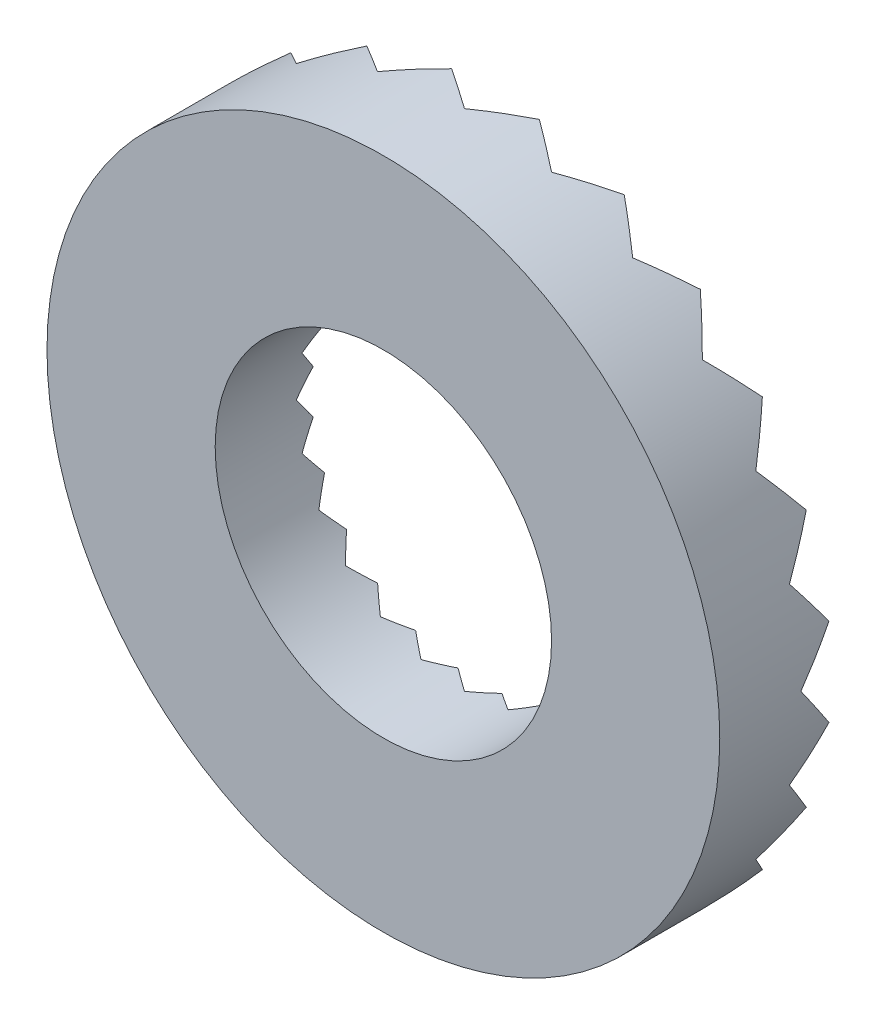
ISO-10303-21;
HEADER;
FILE_DESCRIPTION(('STEP AP214'),'2;1');
FILE_NAME('part.step','',(''),(''),'','','');
FILE_SCHEMA(('AUTOMOTIVE_DESIGN { 1 0 10303 214 1 1 1 1 }'));
ENDSEC;
DATA;
#1=APPLICATION_CONTEXT('core data for automotive mechanical design processes');
#2=APPLICATION_PROTOCOL_DEFINITION('international standard','automotive_design',2000,#1);
#3=PRODUCT_CONTEXT('',#1,'mechanical');
#4=PRODUCT('Part','Part','',(#3));
#5=PRODUCT_RELATED_PRODUCT_CATEGORY('part','',(#4));
#6=PRODUCT_DEFINITION_FORMATION('','',#4);
#7=PRODUCT_DEFINITION_CONTEXT('part definition',#1,'design');
#8=PRODUCT_DEFINITION('design','',#6,#7);
#9=PRODUCT_DEFINITION_SHAPE('','',#8);
#10=(LENGTH_UNIT() NAMED_UNIT(*) SI_UNIT(.MILLI.,.METRE.));
#11=(NAMED_UNIT(*) PLANE_ANGLE_UNIT() SI_UNIT($,.RADIAN.));
#12=(NAMED_UNIT(*) SI_UNIT($,.STERADIAN.) SOLID_ANGLE_UNIT());
#13=UNCERTAINTY_MEASURE_WITH_UNIT(LENGTH_MEASURE(1.E-05),#10,'distance_accuracy_value','');
#14=(GEOMETRIC_REPRESENTATION_CONTEXT(3) GLOBAL_UNCERTAINTY_ASSIGNED_CONTEXT((#13)) GLOBAL_UNIT_ASSIGNED_CONTEXT((#10,
#11,#12)) REPRESENTATION_CONTEXT('',''));
#15=CARTESIAN_POINT('',(0.,0.,0.));
#16=DIRECTION('',(0.,0.,1.));
#17=DIRECTION('',(1.,0.,0.));
#18=AXIS2_PLACEMENT_3D('',#15,#16,#17);
#19=CARTESIAN_POINT('',(0.,0.,6.44689557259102));
#20=DIRECTION('',(0.,0.,-1.));
#21=DIRECTION('',(-1.,0.,0.));
#22=AXIS2_PLACEMENT_3D('',#19,#20,#21);
#23=CYLINDRICAL_SURFACE('',#22,6.);
#24=CARTESIAN_POINT('',(0.,0.,5.));
#25=DIRECTION('',(0.576883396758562,0.,0.816826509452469));
#26=DIRECTION('',(0.816826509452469,0.,-0.576883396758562));
#27=AXIS2_PLACEMENT_3D('',#24,#25,#26);
#28=ELLIPSE('',#27,7.34550107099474,6.);
#29=CARTESIAN_POINT('',(0.,-6.,5.));
#30=VERTEX_POINT('',#29);
#31=CARTESIAN_POINT('',(0.78315715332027,-5.94866916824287,4.44689557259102));
#32=VERTEX_POINT('',#31);
#33=EDGE_CURVE('E645',#30,#32,#28,.T.);
#34=ORIENTED_EDGE('',*,*,#33,.T.);
#35=CARTESIAN_POINT('',(0.,0.,5.));
#36=DIRECTION('',(-0.557226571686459,-0.149308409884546,0.816826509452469));
#37=DIRECTION('',(-0.788993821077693,-0.211410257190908,-0.576883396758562));
#38=AXIS2_PLACEMENT_3D('',#35,#36,#37);
#39=ELLIPSE('',#38,7.34550107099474,6.);
#40=CARTESIAN_POINT('',(1.55291427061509,-5.79555495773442,5.));
#41=VERTEX_POINT('',#40);
#42=EDGE_CURVE('E1038',#32,#41,#39,.T.);
#43=ORIENTED_EDGE('',*,*,#42,.T.);
#44=CARTESIAN_POINT('',(0.,0.,5.));
#45=DIRECTION('',(0.557226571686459,0.149308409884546,0.816826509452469));
#46=DIRECTION('',(0.788993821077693,0.211410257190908,-0.576883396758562));
#47=AXIS2_PLACEMENT_3D('',#44,#45,#46);
#48=ELLIPSE('',#47,7.34550107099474,6.);
#49=CARTESIAN_POINT('',(2.2961005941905,-5.54327719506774,4.44689557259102));
#50=VERTEX_POINT('',#49);
#51=EDGE_CURVE('E1054',#41,#50,#48,.T.);
#52=ORIENTED_EDGE('',*,*,#51,.T.);
#53=CARTESIAN_POINT('',(0.,0.,5.));
#54=DIRECTION('',(-0.499595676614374,-0.288441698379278,0.816826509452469));
#55=DIRECTION('',(-0.70739250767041,-0.40841325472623,-0.576883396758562));
#56=AXIS2_PLACEMENT_3D('',#53,#54,#55);
#57=ELLIPSE('',#56,7.34550107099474,6.);
#58=CARTESIAN_POINT('',(2.99999999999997,-5.19615242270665,5.));
#59=VERTEX_POINT('',#58);
#60=EDGE_CURVE('E637',#50,#59,#57,.T.);
#61=ORIENTED_EDGE('',*,*,#60,.T.);
#62=CARTESIAN_POINT('',(0.,0.,5.));
#63=DIRECTION('',(0.499595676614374,0.288441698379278,0.816826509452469));
#64=DIRECTION('',(0.70739250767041,0.40841325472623,-0.576883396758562));
#65=AXIS2_PLACEMENT_3D('',#62,#63,#64);
#66=ELLIPSE('',#65,7.34550107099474,6.);
#67=CARTESIAN_POINT('',(3.6525685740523,-4.76012004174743,4.44689557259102));
#68=VERTEX_POINT('',#67);
#69=EDGE_CURVE('E665',#59,#68,#66,.T.);
#70=ORIENTED_EDGE('',*,*,#69,.T.);
#71=CARTESIAN_POINT('',(0.,0.,5.));
#72=DIRECTION('',(-0.407918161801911,-0.407918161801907,0.816826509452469));
#73=DIRECTION('',(-0.577583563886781,-0.577583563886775,-0.576883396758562));
#74=AXIS2_PLACEMENT_3D('',#71,#72,#73);
#75=ELLIPSE('',#74,7.34550107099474,6.);
#76=CARTESIAN_POINT('',(4.24264068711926,-4.24264068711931,5.));
#77=VERTEX_POINT('',#76);
#78=EDGE_CURVE('E1061',#68,#77,#75,.T.);
#79=ORIENTED_EDGE('',*,*,#78,.T.);
#80=CARTESIAN_POINT('',(0.,0.,5.));
#81=DIRECTION('',(0.407918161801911,0.407918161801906,0.816826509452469));
#82=DIRECTION('',(0.577583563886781,0.577583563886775,-0.576883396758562));
#83=AXIS2_PLACEMENT_3D('',#80,#81,#82);
#84=ELLIPSE('',#83,7.34550107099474,6.);
#85=CARTESIAN_POINT('',(4.76012004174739,-3.65256857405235,4.44689557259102));
#86=VERTEX_POINT('',#85);
#87=EDGE_CURVE('E1078',#77,#86,#84,.T.);
#88=ORIENTED_EDGE('',*,*,#87,.T.);
#89=CARTESIAN_POINT('',(0.,0.,5.));
#90=DIRECTION('',(-0.288441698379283,-0.499595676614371,0.816826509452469));
#91=DIRECTION('',(-0.408413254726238,-0.707392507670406,-0.576883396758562));
#92=AXIS2_PLACEMENT_3D('',#89,#90,#91);
#93=ELLIPSE('',#92,7.34550107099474,6.);
#94=CARTESIAN_POINT('',(5.19615242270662,-3.00000000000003,5.));
#95=VERTEX_POINT('',#94);
#96=EDGE_CURVE('E657',#86,#95,#93,.T.);
#97=ORIENTED_EDGE('',*,*,#96,.T.);
#98=CARTESIAN_POINT('',(0.,0.,5.));
#99=DIRECTION('',(0.288441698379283,0.499595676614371,0.816826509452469));
#100=DIRECTION('',(0.408413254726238,0.707392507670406,-0.576883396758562));
#101=AXIS2_PLACEMENT_3D('',#98,#99,#100);
#102=ELLIPSE('',#101,7.34550107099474,6.);
#103=CARTESIAN_POINT('',(5.54327719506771,-2.29610059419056,4.44689557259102));
#104=VERTEX_POINT('',#103);
#105=EDGE_CURVE('E685',#95,#104,#102,.T.);
#106=ORIENTED_EDGE('',*,*,#105,.T.);
#107=CARTESIAN_POINT('',(0.,0.,5.));
#108=DIRECTION('',(-0.149308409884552,-0.557226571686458,0.816826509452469));
#109=DIRECTION('',(-0.211410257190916,-0.78899382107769,-0.576883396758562));
#110=AXIS2_PLACEMENT_3D('',#107,#108,#109);
#111=ELLIPSE('',#110,7.34550107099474,6.);
#112=CARTESIAN_POINT('',(5.7955549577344,-1.55291427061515,5.));
#113=VERTEX_POINT('',#112);
#114=EDGE_CURVE('E1085',#104,#113,#111,.T.);
#115=ORIENTED_EDGE('',*,*,#114,.T.);
#116=CARTESIAN_POINT('',(0.,0.,5.));
#117=DIRECTION('',(0.149308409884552,0.557226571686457,0.816826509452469));
#118=DIRECTION('',(0.211410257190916,0.78899382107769,-0.576883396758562));
#119=AXIS2_PLACEMENT_3D('',#116,#117,#118);
#120=ELLIPSE('',#119,7.34550107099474,6.);
#121=CARTESIAN_POINT('',(5.94866916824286,-0.783157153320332,4.44689557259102));
#122=VERTEX_POINT('',#121);
#123=EDGE_CURVE('E1102',#113,#122,#120,.T.);
#124=ORIENTED_EDGE('',*,*,#123,.T.);
#125=CARTESIAN_POINT('',(0.,0.,5.));
#126=DIRECTION('',(0.,-0.576883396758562,0.816826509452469));
#127=DIRECTION('',(0.,-0.816826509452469,-0.576883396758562));
#128=AXIS2_PLACEMENT_3D('',#125,#126,#127);
#129=ELLIPSE('',#128,7.34550107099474,6.);
#130=CARTESIAN_POINT('',(6.,0.,5.));
#131=VERTEX_POINT('',#130);
#132=EDGE_CURVE('E677',#122,#131,#129,.T.);
#133=ORIENTED_EDGE('',*,*,#132,.T.);
#134=CARTESIAN_POINT('',(0.,0.,5.));
#135=DIRECTION('',(0.,0.576883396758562,0.816826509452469));
#136=DIRECTION('',(0.,0.816826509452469,-0.576883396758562));
#137=AXIS2_PLACEMENT_3D('',#134,#135,#136);
#138=ELLIPSE('',#137,7.34550107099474,6.);
#139=CARTESIAN_POINT('',(5.94866916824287,0.783157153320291,4.44689557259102));
#140=VERTEX_POINT('',#139);
#141=EDGE_CURVE('E705',#131,#140,#138,.T.);
#142=ORIENTED_EDGE('',*,*,#141,.T.);
#143=CARTESIAN_POINT('',(0.,0.,5.));
#144=DIRECTION('',(0.149308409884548,-0.557226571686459,0.816826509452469));
#145=DIRECTION('',(0.211410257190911,-0.788993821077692,-0.576883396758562));
#146=AXIS2_PLACEMENT_3D('',#143,#144,#145);
#147=ELLIPSE('',#146,7.34550107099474,6.);
#148=CARTESIAN_POINT('',(5.79555495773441,1.55291427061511,5.));
#149=VERTEX_POINT('',#148);
#150=EDGE_CURVE('E1109',#140,#149,#147,.T.);
#151=ORIENTED_EDGE('',*,*,#150,.T.);
#152=CARTESIAN_POINT('',(0.,0.,5.));
#153=DIRECTION('',(-0.149308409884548,0.557226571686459,0.816826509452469));
#154=DIRECTION('',(-0.211410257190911,0.788993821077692,-0.576883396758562));
#155=AXIS2_PLACEMENT_3D('',#152,#153,#154);
#156=ELLIPSE('',#155,7.34550107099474,6.);
#157=CARTESIAN_POINT('',(5.54327719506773,2.29610059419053,4.44689557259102));
#158=VERTEX_POINT('',#157);
#159=EDGE_CURVE('E1126',#149,#158,#156,.T.);
#160=ORIENTED_EDGE('',*,*,#159,.T.);
#161=CARTESIAN_POINT('',(0.,0.,5.));
#162=DIRECTION('',(0.28844169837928,-0.499595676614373,0.816826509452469));
#163=DIRECTION('',(0.408413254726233,-0.707392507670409,-0.576883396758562));
#164=AXIS2_PLACEMENT_3D('',#161,#162,#163);
#165=ELLIPSE('',#164,7.34550107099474,6.);
#166=CARTESIAN_POINT('',(5.19615242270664,2.99999999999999,5.));
#167=VERTEX_POINT('',#166);
#168=EDGE_CURVE('E697',#158,#167,#165,.T.);
#169=ORIENTED_EDGE('',*,*,#168,.T.);
#170=CARTESIAN_POINT('',(0.,0.,5.));
#171=DIRECTION('',(-0.28844169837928,0.499595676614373,0.816826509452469));
#172=DIRECTION('',(-0.408413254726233,0.707392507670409,-0.576883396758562));
#173=AXIS2_PLACEMENT_3D('',#170,#171,#172);
#174=ELLIPSE('',#173,7.34550107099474,6.);
#175=CARTESIAN_POINT('',(4.76012004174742,3.65256857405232,4.44689557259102));
#176=VERTEX_POINT('',#175);
#177=EDGE_CURVE('E725',#167,#176,#174,.T.);
#178=ORIENTED_EDGE('',*,*,#177,.T.);
#179=CARTESIAN_POINT('',(0.,0.,5.));
#180=DIRECTION('',(0.407918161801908,-0.407918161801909,0.816826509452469));
#181=DIRECTION('',(0.577583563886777,-0.577583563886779,-0.576883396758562));
#182=AXIS2_PLACEMENT_3D('',#179,#180,#181);
#183=ELLIPSE('',#182,7.34550107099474,6.);
#184=CARTESIAN_POINT('',(4.24264068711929,4.24264068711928,5.));
#185=VERTEX_POINT('',#184);
#186=EDGE_CURVE('E1133',#176,#185,#183,.T.);
#187=ORIENTED_EDGE('',*,*,#186,.T.);
#188=CARTESIAN_POINT('',(0.,0.,5.));
#189=DIRECTION('',(-0.407918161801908,0.407918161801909,0.816826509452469));
#190=DIRECTION('',(-0.577583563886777,0.577583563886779,-0.576883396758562));
#191=AXIS2_PLACEMENT_3D('',#188,#189,#190);
#192=ELLIPSE('',#191,7.34550107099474,6.);
#193=CARTESIAN_POINT('',(3.65256857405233,4.76012004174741,4.44689557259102));
#194=VERTEX_POINT('',#193);
#195=EDGE_CURVE('E748',#185,#194,#192,.T.);
#196=ORIENTED_EDGE('',*,*,#195,.T.);
#197=CARTESIAN_POINT('',(0.,0.,5.));
#198=DIRECTION('',(0.499595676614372,-0.288441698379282,0.816826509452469));
#199=DIRECTION('',(0.707392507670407,-0.408413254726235,-0.576883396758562));
#200=AXIS2_PLACEMENT_3D('',#197,#198,#199);
#201=ELLIPSE('',#200,7.34550107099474,6.);
#202=CARTESIAN_POINT('',(3.00000000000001,5.19615242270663,5.));
#203=VERTEX_POINT('',#202);
#204=EDGE_CURVE('E717',#194,#203,#201,.T.);
#205=ORIENTED_EDGE('',*,*,#204,.T.);
#206=CARTESIAN_POINT('',(0.,0.,5.));
#207=DIRECTION('',(-0.499595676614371,0.288441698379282,0.816826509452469));
#208=DIRECTION('',(-0.707392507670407,0.408413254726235,-0.576883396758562));
#209=AXIS2_PLACEMENT_3D('',#206,#207,#208);
#210=ELLIPSE('',#209,7.34550107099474,6.);
#211=CARTESIAN_POINT('',(2.29610059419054,5.54327719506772,4.44689557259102));
#212=VERTEX_POINT('',#211);
#213=EDGE_CURVE('E741',#203,#212,#210,.T.);
#214=ORIENTED_EDGE('',*,*,#213,.T.);
#215=CARTESIAN_POINT('',(0.,0.,5.));
#216=DIRECTION('',(0.557226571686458,-0.14930840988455,0.816826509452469));
#217=DIRECTION('',(0.788993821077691,-0.211410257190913,-0.576883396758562));
#218=AXIS2_PLACEMENT_3D('',#215,#216,#217);
#219=ELLIPSE('',#218,7.34550107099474,6.);
#220=CARTESIAN_POINT('',(1.55291427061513,5.79555495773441,5.));
#221=VERTEX_POINT('',#220);
#222=EDGE_CURVE('E744',#212,#221,#219,.T.);
#223=ORIENTED_EDGE('',*,*,#222,.T.);
#224=CARTESIAN_POINT('',(0.,0.,5.));
#225=DIRECTION('',(-0.557226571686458,0.14930840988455,0.816826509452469));
#226=DIRECTION('',(-0.788993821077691,0.211410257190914,-0.576883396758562));
#227=AXIS2_PLACEMENT_3D('',#224,#225,#226);
#228=ELLIPSE('',#227,7.34550107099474,6.);
#229=CARTESIAN_POINT('',(0.783157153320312,5.94866916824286,4.44689557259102));
#230=VERTEX_POINT('',#229);
#231=EDGE_CURVE('E506',#221,#230,#228,.T.);
#232=ORIENTED_EDGE('',*,*,#231,.T.);
#233=CARTESIAN_POINT('',(0.,0.,5.));
#234=DIRECTION('',(0.576883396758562,0.,0.816826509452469));
#235=DIRECTION('',(0.816826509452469,0.,-0.576883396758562));
#236=AXIS2_PLACEMENT_3D('',#233,#234,#235);
#237=ELLIPSE('',#236,7.34550107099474,6.);
#238=CARTESIAN_POINT('',(0.,6.,4.99999999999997));
#239=VERTEX_POINT('',#238);
#240=EDGE_CURVE('E502',#230,#239,#237,.T.);
#241=ORIENTED_EDGE('',*,*,#240,.T.);
#242=CARTESIAN_POINT('',(0.,0.,5.));
#243=DIRECTION('',(-0.576883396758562,0.,0.816826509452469));
#244=DIRECTION('',(-0.816826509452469,0.,-0.576883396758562));
#245=AXIS2_PLACEMENT_3D('',#242,#243,#244);
#246=ELLIPSE('',#245,7.34550107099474,6.);
#247=CARTESIAN_POINT('',(-0.783157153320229,5.94866916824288,4.44689557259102));
#248=VERTEX_POINT('',#247);
#249=EDGE_CURVE('E528',#239,#248,#246,.T.);
#250=ORIENTED_EDGE('',*,*,#249,.T.);
#251=CARTESIAN_POINT('',(0.,0.,5.));
#252=DIRECTION('',(0.55722657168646,0.149308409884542,0.816826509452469));
#253=DIRECTION('',(0.788993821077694,0.211410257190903,-0.576883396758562));
#254=AXIS2_PLACEMENT_3D('',#251,#252,#253);
#255=ELLIPSE('',#254,7.34550107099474,6.);
#256=CARTESIAN_POINT('',(-1.55291427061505,5.79555495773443,5.));
#257=VERTEX_POINT('',#256);
#258=EDGE_CURVE('E788',#248,#257,#255,.T.);
#259=ORIENTED_EDGE('',*,*,#258,.T.);
#260=CARTESIAN_POINT('',(0.,0.,5.));
#261=DIRECTION('',(-0.55722657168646,-0.149308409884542,0.816826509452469));
#262=DIRECTION('',(-0.788993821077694,-0.211410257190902,-0.576883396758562));
#263=AXIS2_PLACEMENT_3D('',#260,#261,#262);
#264=ELLIPSE('',#263,7.34550107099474,6.);
#265=CARTESIAN_POINT('',(-2.29610059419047,5.54327719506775,4.44689557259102));
#266=VERTEX_POINT('',#265);
#267=EDGE_CURVE('E192',#257,#266,#264,.T.);
#268=ORIENTED_EDGE('',*,*,#267,.T.);
#269=CARTESIAN_POINT('',(0.,0.,5.));
#270=DIRECTION('',(0.499595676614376,0.288441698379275,0.816826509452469));
#271=DIRECTION('',(0.707392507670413,0.408413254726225,-0.576883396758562));
#272=AXIS2_PLACEMENT_3D('',#269,#270,#271);
#273=ELLIPSE('',#272,7.34550107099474,6.);
#274=CARTESIAN_POINT('',(-2.99999999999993,5.19615242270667,5.));
#275=VERTEX_POINT('',#274);
#276=EDGE_CURVE('E488',#266,#275,#273,.T.);
#277=ORIENTED_EDGE('',*,*,#276,.T.);
#278=CARTESIAN_POINT('',(0.,0.,5.));
#279=DIRECTION('',(-0.499595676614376,-0.288441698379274,0.816826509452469));
#280=DIRECTION('',(-0.707392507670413,-0.408413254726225,-0.576883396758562));
#281=AXIS2_PLACEMENT_3D('',#278,#279,#280);
#282=ELLIPSE('',#281,7.34550107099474,6.);
#283=CARTESIAN_POINT('',(-3.65256857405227,4.76012004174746,4.44689557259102));
#284=VERTEX_POINT('',#283);
#285=EDGE_CURVE('E545',#275,#284,#282,.T.);
#286=ORIENTED_EDGE('',*,*,#285,.T.);
#287=CARTESIAN_POINT('',(0.,0.,5.));
#288=DIRECTION('',(0.407918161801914,0.407918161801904,0.816826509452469));
#289=DIRECTION('',(0.577583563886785,0.577583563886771,-0.576883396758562));
#290=AXIS2_PLACEMENT_3D('',#287,#288,#289);
#291=ELLIPSE('',#290,7.34550107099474,6.);
#292=CARTESIAN_POINT('',(-4.24264068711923,4.24264068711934,5.));
#293=VERTEX_POINT('',#292);
#294=EDGE_CURVE('E923',#284,#293,#291,.T.);
#295=ORIENTED_EDGE('',*,*,#294,.T.);
#296=CARTESIAN_POINT('',(0.,0.,5.));
#297=DIRECTION('',(-0.407918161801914,-0.407918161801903,0.816826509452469));
#298=DIRECTION('',(-0.577583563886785,-0.577583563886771,-0.576883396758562));
#299=AXIS2_PLACEMENT_3D('',#296,#297,#298);
#300=ELLIPSE('',#299,7.34550107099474,6.);
#301=CARTESIAN_POINT('',(-4.76012004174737,3.65256857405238,4.44689557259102));
#302=VERTEX_POINT('',#301);
#303=EDGE_CURVE('E935',#293,#302,#300,.T.);
#304=ORIENTED_EDGE('',*,*,#303,.T.);
#305=CARTESIAN_POINT('',(0.,0.,5.));
#306=DIRECTION('',(0.288441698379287,0.499595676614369,0.816826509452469));
#307=DIRECTION('',(0.408413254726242,0.707392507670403,-0.576883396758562));
#308=AXIS2_PLACEMENT_3D('',#305,#306,#307);
#309=ELLIPSE('',#308,7.34550107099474,6.);
#310=CARTESIAN_POINT('',(-5.1961524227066,3.00000000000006,5.));
#311=VERTEX_POINT('',#310);
#312=EDGE_CURVE('E537',#302,#311,#309,.T.);
#313=ORIENTED_EDGE('',*,*,#312,.T.);
#314=CARTESIAN_POINT('',(0.,0.,5.));
#315=DIRECTION('',(-0.288441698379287,-0.499595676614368,0.816826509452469));
#316=DIRECTION('',(-0.408413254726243,-0.707392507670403,-0.576883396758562));
#317=AXIS2_PLACEMENT_3D('',#314,#315,#316);
#318=ELLIPSE('',#317,7.34550107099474,6.);
#319=CARTESIAN_POINT('',(-5.5432771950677,2.2961005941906,4.44689557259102));
#320=VERTEX_POINT('',#319);
#321=EDGE_CURVE('E565',#311,#320,#318,.T.);
#322=ORIENTED_EDGE('',*,*,#321,.T.);
#323=CARTESIAN_POINT('',(0.,0.,5.));
#324=DIRECTION('',(0.149308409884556,0.557226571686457,0.816826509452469));
#325=DIRECTION('',(0.211410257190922,0.788993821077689,-0.576883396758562));
#326=AXIS2_PLACEMENT_3D('',#323,#324,#325);
#327=ELLIPSE('',#326,7.34550107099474,6.);
#328=CARTESIAN_POINT('',(-5.79555495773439,1.55291427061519,5.));
#329=VERTEX_POINT('',#328);
#330=EDGE_CURVE('E942',#320,#329,#327,.T.);
#331=ORIENTED_EDGE('',*,*,#330,.T.);
#332=CARTESIAN_POINT('',(0.,0.,5.));
#333=DIRECTION('',(-0.149308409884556,-0.557226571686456,0.816826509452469));
#334=DIRECTION('',(-0.211410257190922,-0.788993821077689,-0.576883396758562));
#335=AXIS2_PLACEMENT_3D('',#332,#333,#334);
#336=ELLIPSE('',#335,7.34550107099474,6.);
#337=CARTESIAN_POINT('',(-5.94866916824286,0.783157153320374,4.44689557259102));
#338=VERTEX_POINT('',#337);
#339=EDGE_CURVE('E959',#329,#338,#336,.T.);
#340=ORIENTED_EDGE('',*,*,#339,.T.);
#341=CARTESIAN_POINT('',(0.,0.,5.));
#342=DIRECTION('',(0.,0.576883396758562,0.816826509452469));
#343=DIRECTION('',(0.,0.816826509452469,-0.576883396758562));
#344=AXIS2_PLACEMENT_3D('',#341,#342,#343);
#345=ELLIPSE('',#344,7.34550107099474,6.);
#346=CARTESIAN_POINT('',(-6.,0.,5.));
#347=VERTEX_POINT('',#346);
#348=EDGE_CURVE('E557',#338,#347,#345,.T.);
#349=ORIENTED_EDGE('',*,*,#348,.T.);
#350=CARTESIAN_POINT('',(0.,0.,5.));
#351=DIRECTION('',(0.,-0.576883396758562,0.816826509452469));
#352=DIRECTION('',(0.,-0.816826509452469,-0.576883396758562));
#353=AXIS2_PLACEMENT_3D('',#350,#351,#352);
#354=ELLIPSE('',#353,7.34550107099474,6.);
#355=CARTESIAN_POINT('',(-5.94866916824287,-0.783157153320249,4.44689557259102));
#356=VERTEX_POINT('',#355);
#357=EDGE_CURVE('E585',#347,#356,#354,.T.);
#358=ORIENTED_EDGE('',*,*,#357,.T.);
#359=CARTESIAN_POINT('',(0.,0.,5.));
#360=DIRECTION('',(-0.149308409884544,0.55722657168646,0.816826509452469));
#361=DIRECTION('',(-0.211410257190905,0.788993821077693,-0.576883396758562));
#362=AXIS2_PLACEMENT_3D('',#359,#360,#361);
#363=ELLIPSE('',#362,7.34550107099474,6.);
#364=CARTESIAN_POINT('',(-5.79555495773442,-1.55291427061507,5.));
#365=VERTEX_POINT('',#364);
#366=EDGE_CURVE('E966',#356,#365,#363,.T.);
#367=ORIENTED_EDGE('',*,*,#366,.T.);
#368=CARTESIAN_POINT('',(0.,0.,5.));
#369=DIRECTION('',(0.149308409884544,-0.55722657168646,0.816826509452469));
#370=DIRECTION('',(0.211410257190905,-0.788993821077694,-0.576883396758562));
#371=AXIS2_PLACEMENT_3D('',#368,#369,#370);
#372=ELLIPSE('',#371,7.34550107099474,6.);
#373=CARTESIAN_POINT('',(-5.54327719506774,-2.29610059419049,4.44689557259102));
#374=VERTEX_POINT('',#373);
#375=EDGE_CURVE('E983',#365,#374,#372,.T.);
#376=ORIENTED_EDGE('',*,*,#375,.T.);
#377=CARTESIAN_POINT('',(0.,0.,5.));
#378=DIRECTION('',(-0.288441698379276,0.499595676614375,0.816826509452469));
#379=DIRECTION('',(-0.408413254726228,0.707392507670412,-0.576883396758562));
#380=AXIS2_PLACEMENT_3D('',#377,#378,#379);
#381=ELLIPSE('',#380,7.34550107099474,6.);
#382=CARTESIAN_POINT('',(-5.19615242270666,-2.99999999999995,5.));
#383=VERTEX_POINT('',#382);
#384=EDGE_CURVE('E577',#374,#383,#381,.T.);
#385=ORIENTED_EDGE('',*,*,#384,.T.);
#386=CARTESIAN_POINT('',(0.,0.,5.));
#387=DIRECTION('',(0.288441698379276,-0.499595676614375,0.816826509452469));
#388=DIRECTION('',(0.408413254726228,-0.707392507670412,-0.576883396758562));
#389=AXIS2_PLACEMENT_3D('',#386,#387,#388);
#390=ELLIPSE('',#389,7.34550107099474,6.);
#391=CARTESIAN_POINT('',(-4.76012004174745,-3.65256857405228,4.44689557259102));
#392=VERTEX_POINT('',#391);
#393=EDGE_CURVE('E605',#383,#392,#390,.T.);
#394=ORIENTED_EDGE('',*,*,#393,.T.);
#395=CARTESIAN_POINT('',(0.,0.,5.));
#396=DIRECTION('',(-0.407918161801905,0.407918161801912,0.816826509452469));
#397=DIRECTION('',(-0.577583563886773,0.577583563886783,-0.576883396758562));
#398=AXIS2_PLACEMENT_3D('',#395,#396,#397);
#399=ELLIPSE('',#398,7.34550107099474,6.);
#400=CARTESIAN_POINT('',(-4.24264068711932,-4.24264068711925,5.));
#401=VERTEX_POINT('',#400);
#402=EDGE_CURVE('E990',#392,#401,#399,.T.);
#403=ORIENTED_EDGE('',*,*,#402,.T.);
#404=CARTESIAN_POINT('',(0.,0.,5.));
#405=DIRECTION('',(0.407918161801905,-0.407918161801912,0.816826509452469));
#406=DIRECTION('',(0.577583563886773,-0.577583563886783,-0.576883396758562));
#407=AXIS2_PLACEMENT_3D('',#404,#405,#406);
#408=ELLIPSE('',#407,7.34550107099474,6.);
#409=CARTESIAN_POINT('',(-3.65256857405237,-4.76012004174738,4.44689557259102));
#410=VERTEX_POINT('',#409);
#411=EDGE_CURVE('E1007',#401,#410,#408,.T.);
#412=ORIENTED_EDGE('',*,*,#411,.T.);
#413=CARTESIAN_POINT('',(0.,0.,5.));
#414=DIRECTION('',(-0.49959567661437,0.288441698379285,0.816826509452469));
#415=DIRECTION('',(-0.707392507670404,0.40841325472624,-0.576883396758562));
#416=AXIS2_PLACEMENT_3D('',#413,#414,#415);
#417=ELLIPSE('',#416,7.34550107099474,6.);
#418=CARTESIAN_POINT('',(-3.00000000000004,-5.19615242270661,5.));
#419=VERTEX_POINT('',#418);
#420=EDGE_CURVE('E597',#410,#419,#417,.T.);
#421=ORIENTED_EDGE('',*,*,#420,.T.);
#422=CARTESIAN_POINT('',(0.,0.,5.));
#423=DIRECTION('',(0.499595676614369,-0.288441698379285,0.816826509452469));
#424=DIRECTION('',(0.707392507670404,-0.40841325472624,-0.576883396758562));
#425=AXIS2_PLACEMENT_3D('',#422,#423,#424);
#426=ELLIPSE('',#425,7.34550107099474,6.);
#427=CARTESIAN_POINT('',(-2.29610059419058,-5.5432771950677,4.44689557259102));
#428=VERTEX_POINT('',#427);
#429=EDGE_CURVE('E625',#419,#428,#426,.T.);
#430=ORIENTED_EDGE('',*,*,#429,.T.);
#431=CARTESIAN_POINT('',(0.,0.,5.));
#432=DIRECTION('',(-0.557226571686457,0.149308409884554,0.816826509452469));
#433=DIRECTION('',(-0.78899382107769,0.211410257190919,-0.576883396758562));
#434=AXIS2_PLACEMENT_3D('',#431,#432,#433);
#435=ELLIPSE('',#434,7.34550107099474,6.);
#436=CARTESIAN_POINT('',(-1.55291427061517,-5.7955549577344,5.));
#437=VERTEX_POINT('',#436);
#438=EDGE_CURVE('E1014',#428,#437,#435,.T.);
#439=ORIENTED_EDGE('',*,*,#438,.T.);
#440=CARTESIAN_POINT('',(0.,0.,5.));
#441=DIRECTION('',(0.557226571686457,-0.149308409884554,0.816826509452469));
#442=DIRECTION('',(0.78899382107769,-0.211410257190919,-0.576883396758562));
#443=AXIS2_PLACEMENT_3D('',#440,#441,#442);
#444=ELLIPSE('',#443,7.34550107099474,6.);
#445=CARTESIAN_POINT('',(-0.783157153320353,-5.94866916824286,4.44689557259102));
#446=VERTEX_POINT('',#445);
#447=EDGE_CURVE('E1031',#437,#446,#444,.T.);
#448=ORIENTED_EDGE('',*,*,#447,.T.);
#449=CARTESIAN_POINT('',(0.,0.,5.));
#450=DIRECTION('',(-0.576883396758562,0.,0.816826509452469));
#451=DIRECTION('',(-0.816826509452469,0.,-0.576883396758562));
#452=AXIS2_PLACEMENT_3D('',#449,#450,#451);
#453=ELLIPSE('',#452,7.34550107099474,6.);
#454=EDGE_CURVE('E617',#446,#30,#453,.T.);
#455=ORIENTED_EDGE('',*,*,#454,.T.);
#456=EDGE_LOOP('',(#34,#43,#52,#61,#70,#79,#88,#97,#106,#115,#124,#133,#142,#151,#160,#169,#178,
#187,#196,#205,#214,#223,#232,#241,#250,#259,#268,#277,#286,#295,#304,#313,#322,#331,#340,#349,
#358,#367,#376,#385,#394,#403,#412,#421,#430,#439,#448,#455));
#457=FACE_BOUND('',#456,.T.);
#458=CARTESIAN_POINT('',(0.,0.,6.44689557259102));
#459=DIRECTION('',(0.,0.,1.));
#460=DIRECTION('',(1.,0.,0.));
#461=AXIS2_PLACEMENT_3D('',#458,#459,#460);
#462=CIRCLE('',#461,6.);
#463=CARTESIAN_POINT('',(6.,0.,6.44689557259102));
#464=VERTEX_POINT('',#463);
#465=EDGE_CURVE('E12',#464,#464,#462,.T.);
#466=ORIENTED_EDGE('',*,*,#465,.F.);
#467=EDGE_LOOP('',(#466));
#468=FACE_BOUND('',#467,.T.);
#469=ADVANCED_FACE('F178',(#457,#468),#23,.T.);
#470=CARTESIAN_POINT('',(0.,0.,6.44689557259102));
#471=DIRECTION('',(0.,0.,1.));
#472=DIRECTION('',(1.,0.,0.));
#473=AXIS2_PLACEMENT_3D('',#470,#471,#472);
#474=PLANE('',#473);
#475=CARTESIAN_POINT('',(0.,0.,6.44689557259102));
#476=DIRECTION('',(0.,0.,1.));
#477=DIRECTION('',(1.,0.,0.));
#478=AXIS2_PLACEMENT_3D('',#475,#476,#477);
#479=CIRCLE('',#478,3.);
#480=CARTESIAN_POINT('',(3.,0.,6.44689557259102));
#481=VERTEX_POINT('',#480);
#482=EDGE_CURVE('E181',#481,#481,#479,.T.);
#483=ORIENTED_EDGE('',*,*,#482,.F.);
#484=EDGE_LOOP('',(#483));
#485=FACE_BOUND('',#484,.T.);
#486=ORIENTED_EDGE('',*,*,#465,.T.);
#487=EDGE_LOOP('',(#486));
#488=FACE_BOUND('',#487,.T.);
#489=ADVANCED_FACE('F1157',(#485,#488),#474,.T.);
#490=CARTESIAN_POINT('',(0.,6.25,5.));
#491=DIRECTION('',(0.576883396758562,0.,0.816826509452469));
#492=DIRECTION('',(0.816826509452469,0.,-0.576883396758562));
#493=AXIS2_PLACEMENT_3D('',#490,#491,#492);
#494=PLANE('',#493);
#495=CARTESIAN_POINT('',(0.,0.,5.));
#496=DIRECTION('',(0.576883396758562,0.,0.816826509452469));
#497=DIRECTION('',(0.816826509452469,0.,-0.576883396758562));
#498=AXIS2_PLACEMENT_3D('',#495,#496,#497);
#499=ELLIPSE('',#498,3.67275053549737,3.);
#500=CARTESIAN_POINT('',(0.391578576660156,2.97433458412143,4.72344778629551));
#501=VERTEX_POINT('',#500);
#502=CARTESIAN_POINT('',(0.,3.,5.));
#503=VERTEX_POINT('',#502);
#504=EDGE_CURVE('E200',#501,#503,#499,.T.);
#505=ORIENTED_EDGE('',*,*,#504,.T.);
#506=DIRECTION('',(0.,1.,0.));
#507=VECTOR('',#506,1.);
#508=CARTESIAN_POINT('',(0.,2.65,5.));
#509=LINE('',#508,#507);
#510=EDGE_CURVE('E511',#503,#239,#509,.T.);
#511=ORIENTED_EDGE('',*,*,#510,.T.);
#512=ORIENTED_EDGE('',*,*,#240,.F.);
#513=DIRECTION('',(0.129975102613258,0.987258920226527,-0.0917948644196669));
#514=VECTOR('',#513,1.);
#515=CARTESIAN_POINT('',(0.342935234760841,2.60485171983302,4.75780212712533));
#516=LINE('',#515,#514);
#517=EDGE_CURVE('E735',#501,#230,#516,.T.);
#518=ORIENTED_EDGE('',*,*,#517,.F.);
#519=EDGE_LOOP('',(#505,#511,#512,#518));
#520=FACE_BOUND('',#519,.T.);
#521=ADVANCED_FACE('F783',(#520),#494,.F.);
#522=CARTESIAN_POINT('',(0.80880951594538,6.14351820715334,4.42877860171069));
#523=DIRECTION('',(-0.557226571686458,0.14930840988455,0.816826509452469));
#524=DIRECTION('',(0.826086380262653,0.,0.563543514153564));
#525=AXIS2_PLACEMENT_3D('',#522,#523,#524);
#526=PLANE('',#525);
#527=CARTESIAN_POINT('',(0.,0.,5.));
#528=DIRECTION('',(-0.557226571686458,0.14930840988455,0.816826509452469));
#529=DIRECTION('',(-0.788993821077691,0.211410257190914,-0.576883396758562));
#530=AXIS2_PLACEMENT_3D('',#527,#528,#529);
#531=ELLIPSE('',#530,3.67275053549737,3.);
#532=CARTESIAN_POINT('',(0.776457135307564,2.8977774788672,5.));
#533=VERTEX_POINT('',#532);
#534=EDGE_CURVE('E781',#533,#501,#531,.T.);
#535=ORIENTED_EDGE('',*,*,#534,.T.);
#536=ORIENTED_EDGE('',*,*,#517,.T.);
#537=ORIENTED_EDGE('',*,*,#231,.F.);
#538=DIRECTION('',(0.258819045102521,0.965925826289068,0.));
#539=VECTOR('',#538,1.);
#540=CARTESIAN_POINT('',(0.685870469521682,2.55970343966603,5.));
#541=LINE('',#540,#539);
#542=EDGE_CURVE('E514',#533,#221,#541,.T.);
#543=ORIENTED_EDGE('',*,*,#542,.F.);
#544=EDGE_LOOP('',(#535,#536,#537,#543));
#545=FACE_BOUND('',#544,.T.);
#546=ADVANCED_FACE('F780',(#545),#526,.F.);
#547=CARTESIAN_POINT('',(2.37130951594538,5.72484759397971,4.42877860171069));
#548=DIRECTION('',(-0.499595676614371,0.288441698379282,0.816826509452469));
#549=DIRECTION('',(0.797938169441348,-0.213806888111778,0.563543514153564));
#550=AXIS2_PLACEMENT_3D('',#547,#548,#549);
#551=PLANE('',#550);
#552=CARTESIAN_POINT('',(0.,0.,5.));
#553=DIRECTION('',(-0.499595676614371,0.288441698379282,0.816826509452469));
#554=DIRECTION('',(-0.707392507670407,0.408413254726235,-0.576883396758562));
#555=AXIS2_PLACEMENT_3D('',#552,#553,#554);
#556=ELLIPSE('',#555,3.67275053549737,3.);
#557=CARTESIAN_POINT('',(1.5,2.59807621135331,5.));
#558=VERTEX_POINT('',#557);
#559=CARTESIAN_POINT('',(1.14805029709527,2.77163859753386,4.72344778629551));
#560=VERTEX_POINT('',#559);
#561=EDGE_CURVE('E770',#558,#560,#556,.T.);
#562=ORIENTED_EDGE('',*,*,#561,.T.);
#563=DIRECTION('',(0.381067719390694,0.919978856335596,-0.0917948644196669));
#564=VECTOR('',#563,1.);
#565=CARTESIAN_POINT('',(1.00543523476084,2.4273353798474,4.75780212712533));
#566=LINE('',#565,#564);
#567=EDGE_CURVE('E736',#560,#212,#566,.T.);
#568=ORIENTED_EDGE('',*,*,#567,.T.);
#569=ORIENTED_EDGE('',*,*,#213,.F.);
#570=DIRECTION('',(0.500000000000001,0.866025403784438,0.));
#571=VECTOR('',#570,1.);
#572=CARTESIAN_POINT('',(1.325,2.29496732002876,5.));
#573=LINE('',#572,#571);
#574=EDGE_CURVE('E732',#558,#203,#573,.T.);
#575=ORIENTED_EDGE('',*,*,#574,.F.);
#576=EDGE_LOOP('',(#562,#568,#569,#575));
#577=FACE_BOUND('',#576,.T.);
#578=ADVANCED_FACE('F767',(#577),#551,.F.);
#579=CARTESIAN_POINT('',(1.61761903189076,6.03703641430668,5.));
#580=DIRECTION('',(0.557226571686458,-0.14930840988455,0.816826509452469));
#581=DIRECTION('',(0.788993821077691,-0.211410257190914,-0.576883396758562));
#582=AXIS2_PLACEMENT_3D('',#579,#580,#581);
#583=PLANE('',#582);
#584=CARTESIAN_POINT('',(0.,0.,5.));
#585=DIRECTION('',(0.557226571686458,-0.14930840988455,0.816826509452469));
#586=DIRECTION('',(0.788993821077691,-0.211410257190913,-0.576883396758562));
#587=AXIS2_PLACEMENT_3D('',#584,#585,#586);
#588=ELLIPSE('',#587,3.67275053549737,3.);
#589=EDGE_CURVE('E900',#560,#533,#588,.T.);
#590=ORIENTED_EDGE('',*,*,#589,.T.);
#591=ORIENTED_EDGE('',*,*,#542,.T.);
#592=ORIENTED_EDGE('',*,*,#222,.F.);
#593=ORIENTED_EDGE('',*,*,#567,.F.);
#594=EDGE_LOOP('',(#590,#591,#592,#593));
#595=FACE_BOUND('',#594,.T.);
#596=ADVANCED_FACE('F773',(#595),#583,.F.);
#597=CARTESIAN_POINT('',(3.77220869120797,4.91603807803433,4.42877860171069));
#598=DIRECTION('',(-0.407918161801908,0.407918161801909,0.816826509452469));
#599=DIRECTION('',(0.715411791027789,-0.413043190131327,0.563543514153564));
#600=AXIS2_PLACEMENT_3D('',#597,#598,#599);
#601=PLANE('',#600);
#602=CARTESIAN_POINT('',(0.,0.,5.));
#603=DIRECTION('',(-0.407918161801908,0.407918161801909,0.816826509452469));
#604=DIRECTION('',(-0.577583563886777,0.577583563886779,-0.576883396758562));
#605=AXIS2_PLACEMENT_3D('',#602,#603,#604);
#606=ELLIPSE('',#605,3.67275053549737,3.);
#607=CARTESIAN_POINT('',(2.12132034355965,2.12132034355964,5.));
#608=VERTEX_POINT('',#607);
#609=CARTESIAN_POINT('',(1.82628428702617,2.3800600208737,4.72344778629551));
#610=VERTEX_POINT('',#609);
#611=EDGE_CURVE('E890',#608,#610,#606,.T.);
#612=ORIENTED_EDGE('',*,*,#611,.T.);
#613=DIRECTION('',(0.606191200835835,0.790003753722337,-0.0917948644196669));
#614=VECTOR('',#613,1.);
#615=CARTESIAN_POINT('',(1.59941648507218,2.08440014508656,4.75780212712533));
#616=LINE('',#615,#614);
#617=EDGE_CURVE('E718',#610,#194,#616,.T.);
#618=ORIENTED_EDGE('',*,*,#617,.T.);
#619=ORIENTED_EDGE('',*,*,#195,.F.);
#620=DIRECTION('',(0.707106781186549,0.707106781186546,0.));
#621=VECTOR('',#620,1.);
#622=CARTESIAN_POINT('',(1.87383297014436,1.87383297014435,5.));
#623=LINE('',#622,#621);
#624=EDGE_CURVE('E714',#608,#185,#623,.T.);
#625=ORIENTED_EDGE('',*,*,#624,.F.);
#626=EDGE_LOOP('',(#612,#618,#619,#625));
#627=FACE_BOUND('',#626,.T.);
#628=ADVANCED_FACE('F1147',(#627),#601,.F.);
#629=CARTESIAN_POINT('',(3.12500000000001,5.41265877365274,5.));
#630=DIRECTION('',(0.499595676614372,-0.288441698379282,0.816826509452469));
#631=DIRECTION('',(0.707392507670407,-0.408413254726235,-0.576883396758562));
#632=AXIS2_PLACEMENT_3D('',#629,#630,#631);
#633=PLANE('',#632);
#634=CARTESIAN_POINT('',(0.,0.,5.));
#635=DIRECTION('',(0.499595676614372,-0.288441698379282,0.816826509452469));
#636=DIRECTION('',(0.707392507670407,-0.408413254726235,-0.576883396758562));
#637=AXIS2_PLACEMENT_3D('',#634,#635,#636);
#638=ELLIPSE('',#637,3.67275053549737,3.);
#639=EDGE_CURVE('E764',#610,#558,#638,.T.);
#640=ORIENTED_EDGE('',*,*,#639,.T.);
#641=ORIENTED_EDGE('',*,*,#574,.T.);
#642=ORIENTED_EDGE('',*,*,#204,.F.);
#643=ORIENTED_EDGE('',*,*,#617,.F.);
#644=EDGE_LOOP('',(#640,#641,#642,#643));
#645=FACE_BOUND('',#644,.T.);
#646=ADVANCED_FACE('F761',(#645),#633,.F.);
#647=CARTESIAN_POINT('',(4.91603807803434,3.77220869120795,4.42877860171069));
#648=DIRECTION('',(-0.28844169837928,0.499595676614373,0.816826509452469));
#649=DIRECTION('',(0.584131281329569,-0.584131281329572,0.563543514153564));
#650=AXIS2_PLACEMENT_3D('',#647,#648,#649);
#651=PLANE('',#650);
#652=CARTESIAN_POINT('',(0.,0.,5.));
#653=DIRECTION('',(-0.28844169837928,0.499595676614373,0.816826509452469));
#654=DIRECTION('',(-0.408413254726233,0.707392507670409,-0.576883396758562));
#655=AXIS2_PLACEMENT_3D('',#652,#653,#654);
#656=ELLIPSE('',#655,3.67275053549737,3.);
#657=CARTESIAN_POINT('',(2.59807621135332,1.49999999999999,5.));
#658=VERTEX_POINT('',#657);
#659=CARTESIAN_POINT('',(2.38006002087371,1.82628428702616,4.72344778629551));
#660=VERTEX_POINT('',#659);
#661=EDGE_CURVE('E878',#658,#660,#656,.T.);
#662=ORIENTED_EDGE('',*,*,#661,.T.);
#663=DIRECTION('',(0.790003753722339,0.606191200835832,-0.0917948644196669));
#664=VECTOR('',#663,1.);
#665=CARTESIAN_POINT('',(2.08440014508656,1.59941648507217,4.75780212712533));
#666=LINE('',#665,#664);
#667=EDGE_CURVE('E719',#660,#176,#666,.T.);
#668=ORIENTED_EDGE('',*,*,#667,.T.);
#669=ORIENTED_EDGE('',*,*,#177,.F.);
#670=DIRECTION('',(0.86602540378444,0.499999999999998,0.));
#671=VECTOR('',#670,1.);
#672=CARTESIAN_POINT('',(2.29496732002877,1.325,5.));
#673=LINE('',#672,#671);
#674=EDGE_CURVE('E712',#658,#167,#673,.T.);
#675=ORIENTED_EDGE('',*,*,#674,.F.);
#676=EDGE_LOOP('',(#662,#668,#669,#675));
#677=FACE_BOUND('',#676,.T.);
#678=ADVANCED_FACE('F1141',(#677),#651,.F.);
#679=CARTESIAN_POINT('',(4.41941738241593,4.41941738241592,5.));
#680=DIRECTION('',(0.407918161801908,-0.407918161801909,0.816826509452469));
#681=DIRECTION('',(0.577583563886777,-0.577583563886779,-0.576883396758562));
#682=AXIS2_PLACEMENT_3D('',#679,#680,#681);
#683=PLANE('',#682);
#684=CARTESIAN_POINT('',(0.,0.,5.));
#685=DIRECTION('',(0.407918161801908,-0.407918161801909,0.816826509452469));
#686=DIRECTION('',(0.577583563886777,-0.577583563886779,-0.576883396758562));
#687=AXIS2_PLACEMENT_3D('',#684,#685,#686);
#688=ELLIPSE('',#687,3.67275053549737,3.);
#689=EDGE_CURVE('E881',#660,#608,#688,.T.);
#690=ORIENTED_EDGE('',*,*,#689,.T.);
#691=ORIENTED_EDGE('',*,*,#624,.T.);
#692=ORIENTED_EDGE('',*,*,#186,.F.);
#693=ORIENTED_EDGE('',*,*,#667,.F.);
#694=EDGE_LOOP('',(#690,#691,#692,#693));
#695=FACE_BOUND('',#694,.T.);
#696=ADVANCED_FACE('F1144',(#695),#683,.F.);
#697=CARTESIAN_POINT('',(5.72484759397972,2.37130951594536,4.42877860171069));
#698=DIRECTION('',(-0.149308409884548,0.557226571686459,0.816826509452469));
#699=DIRECTION('',(0.413043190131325,-0.71541179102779,0.563543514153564));
#700=AXIS2_PLACEMENT_3D('',#697,#698,#699);
#701=PLANE('',#700);
#702=CARTESIAN_POINT('',(0.,0.,5.));
#703=DIRECTION('',(-0.149308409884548,0.557226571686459,0.816826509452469));
#704=DIRECTION('',(-0.211410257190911,0.788993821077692,-0.576883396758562));
#705=AXIS2_PLACEMENT_3D('',#702,#703,#704);
#706=ELLIPSE('',#705,3.67275053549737,3.);
#707=CARTESIAN_POINT('',(2.89777747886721,0.776457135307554,5.));
#708=VERTEX_POINT('',#707);
#709=CARTESIAN_POINT('',(2.77163859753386,1.14805029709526,4.72344778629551));
#710=VERTEX_POINT('',#709);
#711=EDGE_CURVE('E866',#708,#710,#706,.T.);
#712=ORIENTED_EDGE('',*,*,#711,.T.);
#713=DIRECTION('',(0.919978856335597,0.381067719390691,-0.0917948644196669));
#714=VECTOR('',#713,1.);
#715=CARTESIAN_POINT('',(2.4273353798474,1.00543523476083,4.75780212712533));
#716=LINE('',#715,#714);
#717=EDGE_CURVE('E698',#710,#158,#716,.T.);
#718=ORIENTED_EDGE('',*,*,#717,.T.);
#719=ORIENTED_EDGE('',*,*,#159,.F.);
#720=DIRECTION('',(0.965925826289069,0.258819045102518,0.));
#721=VECTOR('',#720,1.);
#722=CARTESIAN_POINT('',(2.55970343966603,0.685870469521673,5.));
#723=LINE('',#722,#721);
#724=EDGE_CURVE('E694',#708,#149,#723,.T.);
#725=ORIENTED_EDGE('',*,*,#724,.F.);
#726=EDGE_LOOP('',(#712,#718,#719,#725));
#727=FACE_BOUND('',#726,.T.);
#728=ADVANCED_FACE('F1127',(#727),#701,.F.);
#729=CARTESIAN_POINT('',(5.41265877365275,3.12499999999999,5.));
#730=DIRECTION('',(0.28844169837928,-0.499595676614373,0.816826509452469));
#731=DIRECTION('',(0.408413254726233,-0.707392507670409,-0.576883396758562));
#732=AXIS2_PLACEMENT_3D('',#729,#730,#731);
#733=PLANE('',#732);
#734=CARTESIAN_POINT('',(0.,0.,5.));
#735=DIRECTION('',(0.28844169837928,-0.499595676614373,0.816826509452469));
#736=DIRECTION('',(0.408413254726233,-0.707392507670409,-0.576883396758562));
#737=AXIS2_PLACEMENT_3D('',#734,#735,#736);
#738=ELLIPSE('',#737,3.67275053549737,3.);
#739=EDGE_CURVE('E869',#710,#658,#738,.T.);
#740=ORIENTED_EDGE('',*,*,#739,.T.);
#741=ORIENTED_EDGE('',*,*,#674,.T.);
#742=ORIENTED_EDGE('',*,*,#168,.F.);
#743=ORIENTED_EDGE('',*,*,#717,.F.);
#744=EDGE_LOOP('',(#740,#741,#742,#743));
#745=FACE_BOUND('',#744,.T.);
#746=ADVANCED_FACE('F1139',(#745),#733,.F.);
#747=CARTESIAN_POINT('',(6.14351820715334,0.808809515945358,4.42877860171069));
#748=DIRECTION('',(0.,0.576883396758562,0.816826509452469));
#749=DIRECTION('',(0.213806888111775,-0.797938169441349,0.563543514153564));
#750=AXIS2_PLACEMENT_3D('',#747,#748,#749);
#751=PLANE('',#750);
#752=CARTESIAN_POINT('',(0.,0.,5.));
#753=DIRECTION('',(0.,0.576883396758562,0.816826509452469));
#754=DIRECTION('',(0.,0.816826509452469,-0.576883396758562));
#755=AXIS2_PLACEMENT_3D('',#752,#753,#754);
#756=ELLIPSE('',#755,3.67275053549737,3.);
#757=CARTESIAN_POINT('',(3.,0.,5.));
#758=VERTEX_POINT('',#757);
#759=CARTESIAN_POINT('',(2.97433458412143,0.391578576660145,4.72344778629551));
#760=VERTEX_POINT('',#759);
#761=EDGE_CURVE('E854',#758,#760,#756,.T.);
#762=ORIENTED_EDGE('',*,*,#761,.T.);
#763=DIRECTION('',(0.987258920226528,0.129975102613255,-0.0917948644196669));
#764=VECTOR('',#763,1.);
#765=CARTESIAN_POINT('',(2.60485171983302,0.342935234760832,4.75780212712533));
#766=LINE('',#765,#764);
#767=EDGE_CURVE('E699',#760,#140,#766,.T.);
#768=ORIENTED_EDGE('',*,*,#767,.T.);
#769=ORIENTED_EDGE('',*,*,#141,.F.);
#770=DIRECTION('',(1.,0.,0.));
#771=VECTOR('',#770,1.);
#772=CARTESIAN_POINT('',(2.65,0.,5.));
#773=LINE('',#772,#771);
#774=EDGE_CURVE('E692',#758,#131,#773,.T.);
#775=ORIENTED_EDGE('',*,*,#774,.F.);
#776=EDGE_LOOP('',(#762,#768,#769,#775));
#777=FACE_BOUND('',#776,.T.);
#778=ADVANCED_FACE('F1119',(#777),#751,.F.);
#779=CARTESIAN_POINT('',(6.03703641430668,1.61761903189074,5.));
#780=DIRECTION('',(0.149308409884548,-0.557226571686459,0.816826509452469));
#781=DIRECTION('',(0.211410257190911,-0.788993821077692,-0.576883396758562));
#782=AXIS2_PLACEMENT_3D('',#779,#780,#781);
#783=PLANE('',#782);
#784=CARTESIAN_POINT('',(0.,0.,5.));
#785=DIRECTION('',(0.149308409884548,-0.557226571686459,0.816826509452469));
#786=DIRECTION('',(0.211410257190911,-0.788993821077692,-0.576883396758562));
#787=AXIS2_PLACEMENT_3D('',#784,#785,#786);
#788=ELLIPSE('',#787,3.67275053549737,3.);
#789=EDGE_CURVE('E857',#760,#708,#788,.T.);
#790=ORIENTED_EDGE('',*,*,#789,.T.);
#791=ORIENTED_EDGE('',*,*,#724,.T.);
#792=ORIENTED_EDGE('',*,*,#150,.F.);
#793=ORIENTED_EDGE('',*,*,#767,.F.);
#794=EDGE_LOOP('',(#790,#791,#792,#793));
#795=FACE_BOUND('',#794,.T.);
#796=ADVANCED_FACE('F1122',(#795),#783,.F.);
#797=CARTESIAN_POINT('',(6.14351820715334,-0.808809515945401,4.42877860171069));
#798=DIRECTION('',(0.149308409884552,0.557226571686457,0.816826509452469));
#799=DIRECTION('',(0.,-0.826086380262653,0.563543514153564));
#800=AXIS2_PLACEMENT_3D('',#797,#798,#799);
#801=PLANE('',#800);
#802=CARTESIAN_POINT('',(0.,0.,5.));
#803=DIRECTION('',(0.149308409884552,0.557226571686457,0.816826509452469));
#804=DIRECTION('',(0.211410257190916,0.78899382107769,-0.576883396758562));
#805=AXIS2_PLACEMENT_3D('',#802,#803,#804);
#806=ELLIPSE('',#805,3.67275053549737,3.);
#807=CARTESIAN_POINT('',(2.8977774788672,-0.776457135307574,5.));
#808=VERTEX_POINT('',#807);
#809=CARTESIAN_POINT('',(2.97433458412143,-0.391578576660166,4.72344778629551));
#810=VERTEX_POINT('',#809);
#811=EDGE_CURVE('E842',#808,#810,#806,.T.);
#812=ORIENTED_EDGE('',*,*,#811,.T.);
#813=DIRECTION('',(0.987258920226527,-0.129975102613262,-0.0917948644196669));
#814=VECTOR('',#813,1.);
#815=CARTESIAN_POINT('',(2.60485171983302,-0.34293523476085,4.75780212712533));
#816=LINE('',#815,#814);
#817=EDGE_CURVE('E678',#810,#122,#816,.T.);
#818=ORIENTED_EDGE('',*,*,#817,.T.);
#819=ORIENTED_EDGE('',*,*,#123,.F.);
#820=DIRECTION('',(0.965925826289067,-0.258819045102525,0.));
#821=VECTOR('',#820,1.);
#822=CARTESIAN_POINT('',(2.55970343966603,-0.685870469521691,5.));
#823=LINE('',#822,#821);
#824=EDGE_CURVE('E674',#808,#113,#823,.T.);
#825=ORIENTED_EDGE('',*,*,#824,.F.);
#826=EDGE_LOOP('',(#812,#818,#819,#825));
#827=FACE_BOUND('',#826,.T.);
#828=ADVANCED_FACE('F1103',(#827),#801,.F.);
#829=CARTESIAN_POINT('',(6.25,0.,5.));
#830=DIRECTION('',(0.,-0.576883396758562,0.816826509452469));
#831=DIRECTION('',(0.,-0.816826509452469,-0.576883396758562));
#832=AXIS2_PLACEMENT_3D('',#829,#830,#831);
#833=PLANE('',#832);
#834=CARTESIAN_POINT('',(0.,0.,5.));
#835=DIRECTION('',(0.,-0.576883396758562,0.816826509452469));
#836=DIRECTION('',(0.,-0.816826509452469,-0.576883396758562));
#837=AXIS2_PLACEMENT_3D('',#834,#835,#836);
#838=ELLIPSE('',#837,3.67275053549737,3.);
#839=EDGE_CURVE('E845',#810,#758,#838,.T.);
#840=ORIENTED_EDGE('',*,*,#839,.T.);
#841=ORIENTED_EDGE('',*,*,#774,.T.);
#842=ORIENTED_EDGE('',*,*,#132,.F.);
#843=ORIENTED_EDGE('',*,*,#817,.F.);
#844=EDGE_LOOP('',(#840,#841,#842,#843));
#845=FACE_BOUND('',#844,.T.);
#846=ADVANCED_FACE('F1117',(#845),#833,.F.);
#847=CARTESIAN_POINT('',(5.7248475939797,-2.3713095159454,4.42877860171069));
#848=DIRECTION('',(0.288441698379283,0.499595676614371,0.816826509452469));
#849=DIRECTION('',(-0.213806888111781,-0.797938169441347,0.563543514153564));
#850=AXIS2_PLACEMENT_3D('',#847,#848,#849);
#851=PLANE('',#850);
#852=CARTESIAN_POINT('',(0.,0.,5.));
#853=DIRECTION('',(0.288441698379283,0.499595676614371,0.816826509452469));
#854=DIRECTION('',(0.408413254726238,0.707392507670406,-0.576883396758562));
#855=AXIS2_PLACEMENT_3D('',#852,#853,#854);
#856=ELLIPSE('',#855,3.67275053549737,3.);
#857=CARTESIAN_POINT('',(2.59807621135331,-1.50000000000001,5.));
#858=VERTEX_POINT('',#857);
#859=CARTESIAN_POINT('',(2.77163859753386,-1.14805029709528,4.72344778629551));
#860=VERTEX_POINT('',#859);
#861=EDGE_CURVE('E830',#858,#860,#856,.T.);
#862=ORIENTED_EDGE('',*,*,#861,.T.);
#863=DIRECTION('',(0.919978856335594,-0.381067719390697,-0.0917948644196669));
#864=VECTOR('',#863,1.);
#865=CARTESIAN_POINT('',(2.42733537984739,-1.00543523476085,4.75780212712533));
#866=LINE('',#865,#864);
#867=EDGE_CURVE('E679',#860,#104,#866,.T.);
#868=ORIENTED_EDGE('',*,*,#867,.T.);
#869=ORIENTED_EDGE('',*,*,#105,.F.);
#870=DIRECTION('',(0.866025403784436,-0.500000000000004,0.));
#871=VECTOR('',#870,1.);
#872=CARTESIAN_POINT('',(2.29496732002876,-1.32500000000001,5.));
#873=LINE('',#872,#871);
#874=EDGE_CURVE('E672',#858,#95,#873,.T.);
#875=ORIENTED_EDGE('',*,*,#874,.F.);
#876=EDGE_LOOP('',(#862,#868,#869,#875));
#877=FACE_BOUND('',#876,.T.);
#878=ADVANCED_FACE('F1095',(#877),#851,.F.);
#879=CARTESIAN_POINT('',(6.03703641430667,-1.61761903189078,5.));
#880=DIRECTION('',(-0.149308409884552,-0.557226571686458,0.816826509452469));
#881=DIRECTION('',(-0.211410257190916,-0.78899382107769,-0.576883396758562));
#882=AXIS2_PLACEMENT_3D('',#879,#880,#881);
#883=PLANE('',#882);
#884=CARTESIAN_POINT('',(0.,0.,5.));
#885=DIRECTION('',(-0.149308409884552,-0.557226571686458,0.816826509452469));
#886=DIRECTION('',(-0.211410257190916,-0.78899382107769,-0.576883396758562));
#887=AXIS2_PLACEMENT_3D('',#884,#885,#886);
#888=ELLIPSE('',#887,3.67275053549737,3.);
#889=EDGE_CURVE('E833',#860,#808,#888,.T.);
#890=ORIENTED_EDGE('',*,*,#889,.T.);
#891=ORIENTED_EDGE('',*,*,#824,.T.);
#892=ORIENTED_EDGE('',*,*,#114,.F.);
#893=ORIENTED_EDGE('',*,*,#867,.F.);
#894=EDGE_LOOP('',(#890,#891,#892,#893));
#895=FACE_BOUND('',#894,.T.);
#896=ADVANCED_FACE('F1098',(#895),#883,.F.);
#897=CARTESIAN_POINT('',(4.91603807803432,-3.77220869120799,4.42877860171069));
#898=DIRECTION('',(0.407918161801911,0.407918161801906,0.816826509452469));
#899=DIRECTION('',(-0.41304319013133,-0.715411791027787,0.563543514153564));
#900=AXIS2_PLACEMENT_3D('',#897,#898,#899);
#901=PLANE('',#900);
#902=CARTESIAN_POINT('',(0.,0.,5.));
#903=DIRECTION('',(0.407918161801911,0.407918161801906,0.816826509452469));
#904=DIRECTION('',(0.577583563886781,0.577583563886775,-0.576883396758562));
#905=AXIS2_PLACEMENT_3D('',#902,#903,#904);
#906=ELLIPSE('',#905,3.67275053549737,3.);
#907=CARTESIAN_POINT('',(2.12132034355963,-2.12132034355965,5.));
#908=VERTEX_POINT('',#907);
#909=CARTESIAN_POINT('',(2.3800600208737,-1.82628428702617,4.72344778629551));
#910=VERTEX_POINT('',#909);
#911=EDGE_CURVE('E818',#908,#910,#906,.T.);
#912=ORIENTED_EDGE('',*,*,#911,.T.);
#913=DIRECTION('',(0.790003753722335,-0.606191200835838,-0.0917948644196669));
#914=VECTOR('',#913,1.);
#915=CARTESIAN_POINT('',(2.08440014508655,-1.59941648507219,4.75780212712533));
#916=LINE('',#915,#914);
#917=EDGE_CURVE('E658',#910,#86,#916,.T.);
#918=ORIENTED_EDGE('',*,*,#917,.T.);
#919=ORIENTED_EDGE('',*,*,#87,.F.);
#920=DIRECTION('',(0.707106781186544,-0.707106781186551,0.));
#921=VECTOR('',#920,1.);
#922=CARTESIAN_POINT('',(1.87383297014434,-1.87383297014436,5.));
#923=LINE('',#922,#921);
#924=EDGE_CURVE('E654',#908,#77,#923,.T.);
#925=ORIENTED_EDGE('',*,*,#924,.F.);
#926=EDGE_LOOP('',(#912,#918,#919,#925));
#927=FACE_BOUND('',#926,.T.);
#928=ADVANCED_FACE('F1079',(#927),#901,.F.);
#929=CARTESIAN_POINT('',(5.41265877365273,-3.12500000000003,5.));
#930=DIRECTION('',(-0.288441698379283,-0.499595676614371,0.816826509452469));
#931=DIRECTION('',(-0.408413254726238,-0.707392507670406,-0.576883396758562));
#932=AXIS2_PLACEMENT_3D('',#929,#930,#931);
#933=PLANE('',#932);
#934=CARTESIAN_POINT('',(0.,0.,5.));
#935=DIRECTION('',(-0.288441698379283,-0.499595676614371,0.816826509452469));
#936=DIRECTION('',(-0.408413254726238,-0.707392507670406,-0.576883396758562));
#937=AXIS2_PLACEMENT_3D('',#934,#935,#936);
#938=ELLIPSE('',#937,3.67275053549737,3.);
#939=EDGE_CURVE('E821',#910,#858,#938,.T.);
#940=ORIENTED_EDGE('',*,*,#939,.T.);
#941=ORIENTED_EDGE('',*,*,#874,.T.);
#942=ORIENTED_EDGE('',*,*,#96,.F.);
#943=ORIENTED_EDGE('',*,*,#917,.F.);
#944=EDGE_LOOP('',(#940,#941,#942,#943));
#945=FACE_BOUND('',#944,.T.);
#946=ADVANCED_FACE('F1093',(#945),#933,.F.);
#947=CARTESIAN_POINT('',(3.77220869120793,-4.91603807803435,4.42877860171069));
#948=DIRECTION('',(0.499595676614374,0.288441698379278,0.816826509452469));
#949=DIRECTION('',(-0.584131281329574,-0.584131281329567,0.563543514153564));
#950=AXIS2_PLACEMENT_3D('',#947,#948,#949);
#951=PLANE('',#950);
#952=CARTESIAN_POINT('',(0.,0.,5.));
#953=DIRECTION('',(0.499595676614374,0.288441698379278,0.816826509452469));
#954=DIRECTION('',(0.70739250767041,0.40841325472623,-0.576883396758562));
#955=AXIS2_PLACEMENT_3D('',#952,#953,#954);
#956=ELLIPSE('',#955,3.67275053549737,3.);
#957=CARTESIAN_POINT('',(1.49999999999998,-2.59807621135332,5.));
#958=VERTEX_POINT('',#957);
#959=CARTESIAN_POINT('',(1.82628428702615,-2.38006002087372,4.72344778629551));
#960=VERTEX_POINT('',#959);
#961=EDGE_CURVE('E806',#958,#960,#956,.T.);
#962=ORIENTED_EDGE('',*,*,#961,.T.);
#963=DIRECTION('',(0.60619120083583,-0.790003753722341,-0.0917948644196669));
#964=VECTOR('',#963,1.);
#965=CARTESIAN_POINT('',(1.59941648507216,-2.08440014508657,4.75780212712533));
#966=LINE('',#965,#964);
#967=EDGE_CURVE('E659',#960,#68,#966,.T.);
#968=ORIENTED_EDGE('',*,*,#967,.T.);
#969=ORIENTED_EDGE('',*,*,#69,.F.);
#970=DIRECTION('',(0.499999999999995,-0.866025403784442,0.));
#971=VECTOR('',#970,1.);
#972=CARTESIAN_POINT('',(1.32499999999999,-2.29496732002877,5.));
#973=LINE('',#972,#971);
#974=EDGE_CURVE('E652',#958,#59,#973,.T.);
#975=ORIENTED_EDGE('',*,*,#974,.F.);
#976=EDGE_LOOP('',(#962,#968,#969,#975));
#977=FACE_BOUND('',#976,.T.);
#978=ADVANCED_FACE('F1071',(#977),#951,.F.);
#979=CARTESIAN_POINT('',(4.4194173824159,-4.41941738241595,5.));
#980=DIRECTION('',(-0.407918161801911,-0.407918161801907,0.816826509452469));
#981=DIRECTION('',(-0.577583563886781,-0.577583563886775,-0.576883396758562));
#982=AXIS2_PLACEMENT_3D('',#979,#980,#981);
#983=PLANE('',#982);
#984=CARTESIAN_POINT('',(0.,0.,5.));
#985=DIRECTION('',(-0.407918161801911,-0.407918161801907,0.816826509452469));
#986=DIRECTION('',(-0.577583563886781,-0.577583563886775,-0.576883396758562));
#987=AXIS2_PLACEMENT_3D('',#984,#985,#986);
#988=ELLIPSE('',#987,3.67275053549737,3.);
#989=EDGE_CURVE('E809',#960,#908,#988,.T.);
#990=ORIENTED_EDGE('',*,*,#989,.T.);
#991=ORIENTED_EDGE('',*,*,#924,.T.);
#992=ORIENTED_EDGE('',*,*,#78,.F.);
#993=ORIENTED_EDGE('',*,*,#967,.F.);
#994=EDGE_LOOP('',(#990,#991,#992,#993));
#995=FACE_BOUND('',#994,.T.);
#996=ADVANCED_FACE('F1074',(#995),#983,.F.);
#997=CARTESIAN_POINT('',(2.37130951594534,-5.72484759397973,4.42877860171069));
#998=DIRECTION('',(0.557226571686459,0.149308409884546,0.816826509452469));
#999=DIRECTION('',(-0.715411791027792,-0.413043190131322,0.563543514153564));
#1000=AXIS2_PLACEMENT_3D('',#997,#998,#999);
#1001=PLANE('',#1000);
#1002=CARTESIAN_POINT('',(0.,0.,5.));
#1003=DIRECTION('',(0.557226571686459,0.149308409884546,0.816826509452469));
#1004=DIRECTION('',(0.788993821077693,0.211410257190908,-0.576883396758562));
#1005=AXIS2_PLACEMENT_3D('',#1002,#1003,#1004);
#1006=ELLIPSE('',#1005,3.67275053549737,3.);
#1007=CARTESIAN_POINT('',(0.776457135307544,-2.89777747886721,5.));
#1008=VERTEX_POINT('',#1007);
#1009=CARTESIAN_POINT('',(1.14805029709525,-2.77163859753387,4.72344778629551));
#1010=VERTEX_POINT('',#1009);
#1011=EDGE_CURVE('E794',#1008,#1010,#1006,.T.);
#1012=ORIENTED_EDGE('',*,*,#1011,.T.);
#1013=DIRECTION('',(0.381067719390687,-0.919978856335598,-0.0917948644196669));
#1014=VECTOR('',#1013,1.);
#1015=CARTESIAN_POINT('',(1.00543523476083,-2.4273353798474,4.75780212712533));
#1016=LINE('',#1015,#1014);
#1017=EDGE_CURVE('E638',#1010,#50,#1016,.T.);
#1018=ORIENTED_EDGE('',*,*,#1017,.T.);
#1019=ORIENTED_EDGE('',*,*,#51,.F.);
#1020=DIRECTION('',(0.258819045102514,-0.96592582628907,0.));
#1021=VECTOR('',#1020,1.);
#1022=CARTESIAN_POINT('',(0.685870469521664,-2.55970343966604,5.));
#1023=LINE('',#1022,#1021);
#1024=EDGE_CURVE('E634',#1008,#41,#1023,.T.);
#1025=ORIENTED_EDGE('',*,*,#1024,.F.);
#1026=EDGE_LOOP('',(#1012,#1018,#1019,#1025));
#1027=FACE_BOUND('',#1026,.T.);
#1028=ADVANCED_FACE('F1055',(#1027),#1001,.F.);
#1029=CARTESIAN_POINT('',(3.12499999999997,-5.41265877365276,5.));
#1030=DIRECTION('',(-0.499595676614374,-0.288441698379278,0.816826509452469));
#1031=DIRECTION('',(-0.70739250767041,-0.40841325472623,-0.576883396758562));
#1032=AXIS2_PLACEMENT_3D('',#1029,#1030,#1031);
#1033=PLANE('',#1032);
#1034=CARTESIAN_POINT('',(0.,0.,5.));
#1035=DIRECTION('',(-0.499595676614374,-0.288441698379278,0.816826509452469));
#1036=DIRECTION('',(-0.70739250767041,-0.40841325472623,-0.576883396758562));
#1037=AXIS2_PLACEMENT_3D('',#1034,#1035,#1036);
#1038=ELLIPSE('',#1037,3.67275053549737,3.);
#1039=EDGE_CURVE('E797',#1010,#958,#1038,.T.);
#1040=ORIENTED_EDGE('',*,*,#1039,.T.);
#1041=ORIENTED_EDGE('',*,*,#974,.T.);
#1042=ORIENTED_EDGE('',*,*,#60,.F.);
#1043=ORIENTED_EDGE('',*,*,#1017,.F.);
#1044=EDGE_LOOP('',(#1040,#1041,#1042,#1043));
#1045=FACE_BOUND('',#1044,.T.);
#1046=ADVANCED_FACE('F1069',(#1045),#1033,.F.);
#1047=CARTESIAN_POINT('',(0.808809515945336,-6.14351820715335,4.42877860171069));
#1048=DIRECTION('',(0.576883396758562,0.,0.816826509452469));
#1049=DIRECTION('',(-0.79793816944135,-0.213806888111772,0.563543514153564));
#1050=AXIS2_PLACEMENT_3D('',#1047,#1048,#1049);
#1051=PLANE('',#1050);
#1052=CARTESIAN_POINT('',(0.,0.,5.));
#1053=DIRECTION('',(0.576883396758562,0.,0.816826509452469));
#1054=DIRECTION('',(0.816826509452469,0.,-0.576883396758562));
#1055=AXIS2_PLACEMENT_3D('',#1052,#1053,#1054);
#1056=ELLIPSE('',#1055,3.67275053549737,3.);
#1057=CARTESIAN_POINT('',(0.,-3.,5.));
#1058=VERTEX_POINT('',#1057);
#1059=CARTESIAN_POINT('',(0.391578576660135,-2.97433458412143,4.72344778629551));
#1060=VERTEX_POINT('',#1059);
#1061=EDGE_CURVE('E800',#1058,#1060,#1056,.T.);
#1062=ORIENTED_EDGE('',*,*,#1061,.T.);
#1063=DIRECTION('',(0.129975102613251,-0.987258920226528,-0.0917948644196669));
#1064=VECTOR('',#1063,1.);
#1065=CARTESIAN_POINT('',(0.342935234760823,-2.60485171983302,4.75780212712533));
#1066=LINE('',#1065,#1064);
#1067=EDGE_CURVE('E639',#1060,#32,#1066,.T.);
#1068=ORIENTED_EDGE('',*,*,#1067,.T.);
#1069=ORIENTED_EDGE('',*,*,#33,.F.);
#1070=DIRECTION('',(0.,-1.,0.));
#1071=VECTOR('',#1070,1.);
#1072=CARTESIAN_POINT('',(0.,-2.65,5.));
#1073=LINE('',#1072,#1071);
#1074=EDGE_CURVE('E632',#1058,#30,#1073,.T.);
#1075=ORIENTED_EDGE('',*,*,#1074,.F.);
#1076=EDGE_LOOP('',(#1062,#1068,#1069,#1075));
#1077=FACE_BOUND('',#1076,.T.);
#1078=ADVANCED_FACE('F1047',(#1077),#1051,.F.);
#1079=CARTESIAN_POINT('',(1.61761903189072,-6.03703641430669,5.));
#1080=DIRECTION('',(-0.557226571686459,-0.149308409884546,0.816826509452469));
#1081=DIRECTION('',(-0.788993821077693,-0.211410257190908,-0.576883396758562));
#1082=AXIS2_PLACEMENT_3D('',#1079,#1080,#1081);
#1083=PLANE('',#1082);
#1084=CARTESIAN_POINT('',(0.,0.,5.));
#1085=DIRECTION('',(-0.557226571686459,-0.149308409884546,0.816826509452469));
#1086=DIRECTION('',(-0.788993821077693,-0.211410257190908,-0.576883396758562));
#1087=AXIS2_PLACEMENT_3D('',#1084,#1085,#1086);
#1088=ELLIPSE('',#1087,3.67275053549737,3.);
#1089=EDGE_CURVE('E789',#1060,#1008,#1088,.T.);
#1090=ORIENTED_EDGE('',*,*,#1089,.T.);
#1091=ORIENTED_EDGE('',*,*,#1024,.T.);
#1092=ORIENTED_EDGE('',*,*,#42,.F.);
#1093=ORIENTED_EDGE('',*,*,#1067,.F.);
#1094=EDGE_LOOP('',(#1090,#1091,#1092,#1093));
#1095=FACE_BOUND('',#1094,.T.);
#1096=ADVANCED_FACE('F1050',(#1095),#1083,.F.);
#1097=CARTESIAN_POINT('',(-0.808809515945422,-6.14351820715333,4.42877860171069));
#1098=DIRECTION('',(0.557226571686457,-0.149308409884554,0.816826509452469));
#1099=DIRECTION('',(-0.826086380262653,0.,0.563543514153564));
#1100=AXIS2_PLACEMENT_3D('',#1097,#1098,#1099);
#1101=PLANE('',#1100);
#1102=CARTESIAN_POINT('',(0.,0.,5.));
#1103=DIRECTION('',(0.557226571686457,-0.149308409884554,0.816826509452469));
#1104=DIRECTION('',(0.78899382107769,-0.211410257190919,-0.576883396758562));
#1105=AXIS2_PLACEMENT_3D('',#1102,#1103,#1104);
#1106=ELLIPSE('',#1105,3.67275053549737,3.);
#1107=CARTESIAN_POINT('',(-0.776457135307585,-2.8977774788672,5.));
#1108=VERTEX_POINT('',#1107);
#1109=CARTESIAN_POINT('',(-0.391578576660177,-2.97433458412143,4.72344778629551));
#1110=VERTEX_POINT('',#1109);
#1111=EDGE_CURVE('E812',#1108,#1110,#1106,.T.);
#1112=ORIENTED_EDGE('',*,*,#1111,.T.);
#1113=DIRECTION('',(-0.129975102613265,-0.987258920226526,-0.0917948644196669));
#1114=VECTOR('',#1113,1.);
#1115=CARTESIAN_POINT('',(-0.342935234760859,-2.60485171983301,4.75780212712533));
#1116=LINE('',#1115,#1114);
#1117=EDGE_CURVE('E618',#1110,#446,#1116,.T.);
#1118=ORIENTED_EDGE('',*,*,#1117,.T.);
#1119=ORIENTED_EDGE('',*,*,#447,.F.);
#1120=DIRECTION('',(-0.258819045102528,-0.965925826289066,0.));
#1121=VECTOR('',#1120,1.);
#1122=CARTESIAN_POINT('',(-0.6858704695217,-2.55970343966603,5.));
#1123=LINE('',#1122,#1121);
#1124=EDGE_CURVE('E614',#1108,#437,#1123,.T.);
#1125=ORIENTED_EDGE('',*,*,#1124,.F.);
#1126=EDGE_LOOP('',(#1112,#1118,#1119,#1125));
#1127=FACE_BOUND('',#1126,.T.);
#1128=ADVANCED_FACE('F1032',(#1127),#1101,.F.);
#1129=CARTESIAN_POINT('',(0.,-6.25,5.));
#1130=DIRECTION('',(-0.576883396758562,0.,0.816826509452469));
#1131=DIRECTION('',(-0.816826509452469,0.,-0.576883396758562));
#1132=AXIS2_PLACEMENT_3D('',#1129,#1130,#1131);
#1133=PLANE('',#1132);
#1134=CARTESIAN_POINT('',(0.,0.,5.));
#1135=DIRECTION('',(-0.576883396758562,0.,0.816826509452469));
#1136=DIRECTION('',(-0.816826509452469,0.,-0.576883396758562));
#1137=AXIS2_PLACEMENT_3D('',#1134,#1135,#1136);
#1138=ELLIPSE('',#1137,3.67275053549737,3.);
#1139=EDGE_CURVE('E803',#1110,#1058,#1138,.T.);
#1140=ORIENTED_EDGE('',*,*,#1139,.T.);
#1141=ORIENTED_EDGE('',*,*,#1074,.T.);
#1142=ORIENTED_EDGE('',*,*,#454,.F.);
#1143=ORIENTED_EDGE('',*,*,#1117,.F.);
#1144=EDGE_LOOP('',(#1140,#1141,#1142,#1143));
#1145=FACE_BOUND('',#1144,.T.);
#1146=ADVANCED_FACE('F1045',(#1145),#1133,.F.);
#1147=CARTESIAN_POINT('',(-2.37130951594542,-5.72484759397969,4.42877860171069));
#1148=DIRECTION('',(0.499595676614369,-0.288441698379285,0.816826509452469));
#1149=DIRECTION('',(-0.797938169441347,0.213806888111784,0.563543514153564));
#1150=AXIS2_PLACEMENT_3D('',#1147,#1148,#1149);
#1151=PLANE('',#1150);
#1152=CARTESIAN_POINT('',(0.,0.,5.));
#1153=DIRECTION('',(0.499595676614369,-0.288441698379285,0.816826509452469));
#1154=DIRECTION('',(0.707392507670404,-0.40841325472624,-0.576883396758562));
#1155=AXIS2_PLACEMENT_3D('',#1152,#1153,#1154);
#1156=ELLIPSE('',#1155,3.67275053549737,3.);
#1157=CARTESIAN_POINT('',(-1.50000000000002,-2.5980762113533,5.));
#1158=VERTEX_POINT('',#1157);
#1159=CARTESIAN_POINT('',(-1.14805029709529,-2.77163859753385,4.72344778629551));
#1160=VERTEX_POINT('',#1159);
#1161=EDGE_CURVE('E824',#1158,#1160,#1156,.T.);
#1162=ORIENTED_EDGE('',*,*,#1161,.T.);
#1163=DIRECTION('',(-0.3810677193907,-0.919978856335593,-0.0917948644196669));
#1164=VECTOR('',#1163,1.);
#1165=CARTESIAN_POINT('',(-1.00543523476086,-2.42733537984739,4.75780212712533));
#1166=LINE('',#1165,#1164);
#1167=EDGE_CURVE('E619',#1160,#428,#1166,.T.);
#1168=ORIENTED_EDGE('',*,*,#1167,.T.);
#1169=ORIENTED_EDGE('',*,*,#429,.F.);
#1170=DIRECTION('',(-0.500000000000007,-0.866025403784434,0.));
#1171=VECTOR('',#1170,1.);
#1172=CARTESIAN_POINT('',(-1.32500000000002,-2.29496732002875,5.));
#1173=LINE('',#1172,#1171);
#1174=EDGE_CURVE('E612',#1158,#419,#1173,.T.);
#1175=ORIENTED_EDGE('',*,*,#1174,.F.);
#1176=EDGE_LOOP('',(#1162,#1168,#1169,#1175));
#1177=FACE_BOUND('',#1176,.T.);
#1178=ADVANCED_FACE('F1024',(#1177),#1151,.F.);
#1179=CARTESIAN_POINT('',(-1.6176190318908,-6.03703641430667,5.));
#1180=DIRECTION('',(-0.557226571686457,0.149308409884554,0.816826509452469));
#1181=DIRECTION('',(-0.78899382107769,0.211410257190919,-0.576883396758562));
#1182=AXIS2_PLACEMENT_3D('',#1179,#1180,#1181);
#1183=PLANE('',#1182);
#1184=CARTESIAN_POINT('',(0.,0.,5.));
#1185=DIRECTION('',(-0.557226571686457,0.149308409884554,0.816826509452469));
#1186=DIRECTION('',(-0.78899382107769,0.211410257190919,-0.576883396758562));
#1187=AXIS2_PLACEMENT_3D('',#1184,#1185,#1186);
#1188=ELLIPSE('',#1187,3.67275053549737,3.);
#1189=EDGE_CURVE('E815',#1160,#1108,#1188,.T.);
#1190=ORIENTED_EDGE('',*,*,#1189,.T.);
#1191=ORIENTED_EDGE('',*,*,#1124,.T.);
#1192=ORIENTED_EDGE('',*,*,#438,.F.);
#1193=ORIENTED_EDGE('',*,*,#1167,.F.);
#1194=EDGE_LOOP('',(#1190,#1191,#1192,#1193));
#1195=FACE_BOUND('',#1194,.T.);
#1196=ADVANCED_FACE('F1027',(#1195),#1183,.F.);
#1197=CARTESIAN_POINT('',(-3.772208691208,-4.9160380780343,4.42877860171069));
#1198=DIRECTION('',(0.407918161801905,-0.407918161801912,0.816826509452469));
#1199=DIRECTION('',(-0.715411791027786,0.413043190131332,0.563543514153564));
#1200=AXIS2_PLACEMENT_3D('',#1197,#1198,#1199);
#1201=PLANE('',#1200);
#1202=CARTESIAN_POINT('',(0.,0.,5.));
#1203=DIRECTION('',(0.407918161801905,-0.407918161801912,0.816826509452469));
#1204=DIRECTION('',(0.577583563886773,-0.577583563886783,-0.576883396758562));
#1205=AXIS2_PLACEMENT_3D('',#1202,#1203,#1204);
#1206=ELLIPSE('',#1205,3.67275053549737,3.);
#1207=CARTESIAN_POINT('',(-2.12132034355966,-2.12132034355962,5.));
#1208=VERTEX_POINT('',#1207);
#1209=CARTESIAN_POINT('',(-1.82628428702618,-2.38006002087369,4.72344778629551));
#1210=VERTEX_POINT('',#1209);
#1211=EDGE_CURVE('E836',#1208,#1210,#1206,.T.);
#1212=ORIENTED_EDGE('',*,*,#1211,.T.);
#1213=DIRECTION('',(-0.606191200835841,-0.790003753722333,-0.0917948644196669));
#1214=VECTOR('',#1213,1.);
#1215=CARTESIAN_POINT('',(-1.59941648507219,-2.08440014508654,4.75780212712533));
#1216=LINE('',#1215,#1214);
#1217=EDGE_CURVE('E598',#1210,#410,#1216,.T.);
#1218=ORIENTED_EDGE('',*,*,#1217,.T.);
#1219=ORIENTED_EDGE('',*,*,#411,.F.);
#1220=DIRECTION('',(-0.707106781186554,-0.707106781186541,0.));
#1221=VECTOR('',#1220,1.);
#1222=CARTESIAN_POINT('',(-1.87383297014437,-1.87383297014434,5.));
#1223=LINE('',#1222,#1221);
#1224=EDGE_CURVE('E594',#1208,#401,#1223,.T.);
#1225=ORIENTED_EDGE('',*,*,#1224,.F.);
#1226=EDGE_LOOP('',(#1212,#1218,#1219,#1225));
#1227=FACE_BOUND('',#1226,.T.);
#1228=ADVANCED_FACE('F1008',(#1227),#1201,.F.);
#1229=CARTESIAN_POINT('',(-3.12500000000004,-5.41265877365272,5.));
#1230=DIRECTION('',(-0.49959567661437,0.288441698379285,0.816826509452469));
#1231=DIRECTION('',(-0.707392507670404,0.40841325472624,-0.576883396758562));
#1232=AXIS2_PLACEMENT_3D('',#1229,#1230,#1231);
#1233=PLANE('',#1232);
#1234=CARTESIAN_POINT('',(0.,0.,5.));
#1235=DIRECTION('',(-0.49959567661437,0.288441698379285,0.816826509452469));
#1236=DIRECTION('',(-0.707392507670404,0.40841325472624,-0.576883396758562));
#1237=AXIS2_PLACEMENT_3D('',#1234,#1235,#1236);
#1238=ELLIPSE('',#1237,3.67275053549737,3.);
#1239=EDGE_CURVE('E827',#1210,#1158,#1238,.T.);
#1240=ORIENTED_EDGE('',*,*,#1239,.T.);
#1241=ORIENTED_EDGE('',*,*,#1174,.T.);
#1242=ORIENTED_EDGE('',*,*,#420,.F.);
#1243=ORIENTED_EDGE('',*,*,#1217,.F.);
#1244=EDGE_LOOP('',(#1240,#1241,#1242,#1243));
#1245=FACE_BOUND('',#1244,.T.);
#1246=ADVANCED_FACE('F1022',(#1245),#1233,.F.);
#1247=CARTESIAN_POINT('',(-4.91603807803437,-3.77220869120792,4.42877860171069));
#1248=DIRECTION('',(0.288441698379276,-0.499595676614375,0.816826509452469));
#1249=DIRECTION('',(-0.584131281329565,0.584131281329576,0.563543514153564));
#1250=AXIS2_PLACEMENT_3D('',#1247,#1248,#1249);
#1251=PLANE('',#1250);
#1252=CARTESIAN_POINT('',(0.,0.,5.));
#1253=DIRECTION('',(0.288441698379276,-0.499595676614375,0.816826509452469));
#1254=DIRECTION('',(0.408413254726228,-0.707392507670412,-0.576883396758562));
#1255=AXIS2_PLACEMENT_3D('',#1252,#1253,#1254);
#1256=ELLIPSE('',#1255,3.67275053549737,3.);
#1257=CARTESIAN_POINT('',(-2.59807621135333,-1.49999999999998,5.));
#1258=VERTEX_POINT('',#1257);
#1259=CARTESIAN_POINT('',(-2.38006002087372,-1.82628428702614,4.72344778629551));
#1260=VERTEX_POINT('',#1259);
#1261=EDGE_CURVE('E848',#1258,#1260,#1256,.T.);
#1262=ORIENTED_EDGE('',*,*,#1261,.T.);
#1263=DIRECTION('',(-0.790003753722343,-0.606191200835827,-0.0917948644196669));
#1264=VECTOR('',#1263,1.);
#1265=CARTESIAN_POINT('',(-2.08440014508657,-1.59941648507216,4.75780212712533));
#1266=LINE('',#1265,#1264);
#1267=EDGE_CURVE('E599',#1260,#392,#1266,.T.);
#1268=ORIENTED_EDGE('',*,*,#1267,.T.);
#1269=ORIENTED_EDGE('',*,*,#393,.F.);
#1270=DIRECTION('',(-0.866025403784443,-0.499999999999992,0.));
#1271=VECTOR('',#1270,1.);
#1272=CARTESIAN_POINT('',(-2.29496732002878,-1.32499999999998,5.));
#1273=LINE('',#1272,#1271);
#1274=EDGE_CURVE('E592',#1258,#383,#1273,.T.);
#1275=ORIENTED_EDGE('',*,*,#1274,.F.);
#1276=EDGE_LOOP('',(#1262,#1268,#1269,#1275));
#1277=FACE_BOUND('',#1276,.T.);
#1278=ADVANCED_FACE('F1000',(#1277),#1251,.F.);
#1279=CARTESIAN_POINT('',(-4.41941738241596,-4.41941738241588,5.));
#1280=DIRECTION('',(-0.407918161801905,0.407918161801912,0.816826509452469));
#1281=DIRECTION('',(-0.577583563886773,0.577583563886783,-0.576883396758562));
#1282=AXIS2_PLACEMENT_3D('',#1279,#1280,#1281);
#1283=PLANE('',#1282);
#1284=CARTESIAN_POINT('',(0.,0.,5.));
#1285=DIRECTION('',(-0.407918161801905,0.407918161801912,0.816826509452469));
#1286=DIRECTION('',(-0.577583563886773,0.577583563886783,-0.576883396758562));
#1287=AXIS2_PLACEMENT_3D('',#1284,#1285,#1286);
#1288=ELLIPSE('',#1287,3.67275053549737,3.);
#1289=EDGE_CURVE('E839',#1260,#1208,#1288,.T.);
#1290=ORIENTED_EDGE('',*,*,#1289,.T.);
#1291=ORIENTED_EDGE('',*,*,#1224,.T.);
#1292=ORIENTED_EDGE('',*,*,#402,.F.);
#1293=ORIENTED_EDGE('',*,*,#1267,.F.);
#1294=EDGE_LOOP('',(#1290,#1291,#1292,#1293));
#1295=FACE_BOUND('',#1294,.T.);
#1296=ADVANCED_FACE('F1003',(#1295),#1283,.F.);
#1297=CARTESIAN_POINT('',(-5.72484759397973,-2.37130951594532,4.42877860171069));
#1298=DIRECTION('',(0.149308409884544,-0.55722657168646,0.816826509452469));
#1299=DIRECTION('',(-0.41304319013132,0.715411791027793,0.563543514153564));
#1300=AXIS2_PLACEMENT_3D('',#1297,#1298,#1299);
#1301=PLANE('',#1300);
#1302=CARTESIAN_POINT('',(0.,0.,5.));
#1303=DIRECTION('',(0.149308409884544,-0.55722657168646,0.816826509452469));
#1304=DIRECTION('',(0.211410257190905,-0.788993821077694,-0.576883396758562));
#1305=AXIS2_PLACEMENT_3D('',#1302,#1303,#1304);
#1306=ELLIPSE('',#1305,3.67275053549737,3.);
#1307=CARTESIAN_POINT('',(-2.89777747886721,-0.776457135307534,5.));
#1308=VERTEX_POINT('',#1307);
#1309=CARTESIAN_POINT('',(-2.77163859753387,-1.14805029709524,4.72344778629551));
#1310=VERTEX_POINT('',#1309);
#1311=EDGE_CURVE('E860',#1308,#1310,#1306,.T.);
#1312=ORIENTED_EDGE('',*,*,#1311,.T.);
#1313=DIRECTION('',(-0.9199788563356,-0.381067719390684,-0.0917948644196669));
#1314=VECTOR('',#1313,1.);
#1315=CARTESIAN_POINT('',(-2.42733537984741,-1.00543523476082,4.75780212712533));
#1316=LINE('',#1315,#1314);
#1317=EDGE_CURVE('E578',#1310,#374,#1316,.T.);
#1318=ORIENTED_EDGE('',*,*,#1317,.T.);
#1319=ORIENTED_EDGE('',*,*,#375,.F.);
#1320=DIRECTION('',(-0.965925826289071,-0.258819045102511,0.));
#1321=VECTOR('',#1320,1.);
#1322=CARTESIAN_POINT('',(-2.55970343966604,-0.685870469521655,5.));
#1323=LINE('',#1322,#1321);
#1324=EDGE_CURVE('E574',#1308,#365,#1323,.T.);
#1325=ORIENTED_EDGE('',*,*,#1324,.F.);
#1326=EDGE_LOOP('',(#1312,#1318,#1319,#1325));
#1327=FACE_BOUND('',#1326,.T.);
#1328=ADVANCED_FACE('F984',(#1327),#1301,.F.);
#1329=CARTESIAN_POINT('',(-5.41265877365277,-3.12499999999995,5.));
#1330=DIRECTION('',(-0.288441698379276,0.499595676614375,0.816826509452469));
#1331=DIRECTION('',(-0.408413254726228,0.707392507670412,-0.576883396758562));
#1332=AXIS2_PLACEMENT_3D('',#1329,#1330,#1331);
#1333=PLANE('',#1332);
#1334=CARTESIAN_POINT('',(0.,0.,5.));
#1335=DIRECTION('',(-0.288441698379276,0.499595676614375,0.816826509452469));
#1336=DIRECTION('',(-0.408413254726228,0.707392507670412,-0.576883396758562));
#1337=AXIS2_PLACEMENT_3D('',#1334,#1335,#1336);
#1338=ELLIPSE('',#1337,3.67275053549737,3.);
#1339=EDGE_CURVE('E851',#1310,#1258,#1338,.T.);
#1340=ORIENTED_EDGE('',*,*,#1339,.T.);
#1341=ORIENTED_EDGE('',*,*,#1274,.T.);
#1342=ORIENTED_EDGE('',*,*,#384,.F.);
#1343=ORIENTED_EDGE('',*,*,#1317,.F.);
#1344=EDGE_LOOP('',(#1340,#1341,#1342,#1343));
#1345=FACE_BOUND('',#1344,.T.);
#1346=ADVANCED_FACE('F998',(#1345),#1333,.F.);
#1347=CARTESIAN_POINT('',(-6.14351820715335,-0.808809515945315,4.42877860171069));
#1348=DIRECTION('',(0.,-0.576883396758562,0.816826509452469));
#1349=DIRECTION('',(-0.21380688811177,0.79793816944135,0.563543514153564));
#1350=AXIS2_PLACEMENT_3D('',#1347,#1348,#1349);
#1351=PLANE('',#1350);
#1352=CARTESIAN_POINT('',(0.,0.,5.));
#1353=DIRECTION('',(0.,-0.576883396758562,0.816826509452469));
#1354=DIRECTION('',(0.,-0.816826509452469,-0.576883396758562));
#1355=AXIS2_PLACEMENT_3D('',#1352,#1353,#1354);
#1356=ELLIPSE('',#1355,3.67275053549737,3.);
#1357=CARTESIAN_POINT('',(-3.,0.,5.));
#1358=VERTEX_POINT('',#1357);
#1359=CARTESIAN_POINT('',(-2.97433458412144,-0.391578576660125,4.72344778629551));
#1360=VERTEX_POINT('',#1359);
#1361=EDGE_CURVE('E872',#1358,#1360,#1356,.T.);
#1362=ORIENTED_EDGE('',*,*,#1361,.T.);
#1363=DIRECTION('',(-0.987258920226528,-0.129975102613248,-0.0917948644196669));
#1364=VECTOR('',#1363,1.);
#1365=CARTESIAN_POINT('',(-2.60485171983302,-0.342935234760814,4.75780212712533));
#1366=LINE('',#1365,#1364);
#1367=EDGE_CURVE('E579',#1360,#356,#1366,.T.);
#1368=ORIENTED_EDGE('',*,*,#1367,.T.);
#1369=ORIENTED_EDGE('',*,*,#357,.F.);
#1370=DIRECTION('',(-1.,0.,0.));
#1371=VECTOR('',#1370,1.);
#1372=CARTESIAN_POINT('',(-2.65,0.,5.));
#1373=LINE('',#1372,#1371);
#1374=EDGE_CURVE('E572',#1358,#347,#1373,.T.);
#1375=ORIENTED_EDGE('',*,*,#1374,.F.);
#1376=EDGE_LOOP('',(#1362,#1368,#1369,#1375));
#1377=FACE_BOUND('',#1376,.T.);
#1378=ADVANCED_FACE('F976',(#1377),#1351,.F.);
#1379=CARTESIAN_POINT('',(-6.03703641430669,-1.6176190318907,5.));
#1380=DIRECTION('',(-0.149308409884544,0.55722657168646,0.816826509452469));
#1381=DIRECTION('',(-0.211410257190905,0.788993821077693,-0.576883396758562));
#1382=AXIS2_PLACEMENT_3D('',#1379,#1380,#1381);
#1383=PLANE('',#1382);
#1384=CARTESIAN_POINT('',(0.,0.,5.));
#1385=DIRECTION('',(-0.149308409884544,0.55722657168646,0.816826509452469));
#1386=DIRECTION('',(-0.211410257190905,0.788993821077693,-0.576883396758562));
#1387=AXIS2_PLACEMENT_3D('',#1384,#1385,#1386);
#1388=ELLIPSE('',#1387,3.67275053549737,3.);
#1389=EDGE_CURVE('E863',#1360,#1308,#1388,.T.);
#1390=ORIENTED_EDGE('',*,*,#1389,.T.);
#1391=ORIENTED_EDGE('',*,*,#1324,.T.);
#1392=ORIENTED_EDGE('',*,*,#366,.F.);
#1393=ORIENTED_EDGE('',*,*,#1367,.F.);
#1394=EDGE_LOOP('',(#1390,#1391,#1392,#1393));
#1395=FACE_BOUND('',#1394,.T.);
#1396=ADVANCED_FACE('F979',(#1395),#1383,.F.);
#1397=CARTESIAN_POINT('',(-6.14351820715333,0.808809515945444,4.42877860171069));
#1398=DIRECTION('',(-0.149308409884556,-0.557226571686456,0.816826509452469));
#1399=DIRECTION('',(0.,0.826086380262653,0.563543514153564));
#1400=AXIS2_PLACEMENT_3D('',#1397,#1398,#1399);
#1401=PLANE('',#1400);
#1402=CARTESIAN_POINT('',(0.,0.,5.));
#1403=DIRECTION('',(-0.149308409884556,-0.557226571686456,0.816826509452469));
#1404=DIRECTION('',(-0.211410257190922,-0.788993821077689,-0.576883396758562));
#1405=AXIS2_PLACEMENT_3D('',#1402,#1403,#1404);
#1406=ELLIPSE('',#1405,3.67275053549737,3.);
#1407=CARTESIAN_POINT('',(-2.8977774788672,0.776457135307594,5.));
#1408=VERTEX_POINT('',#1407);
#1409=CARTESIAN_POINT('',(-2.97433458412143,0.391578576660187,4.72344778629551));
#1410=VERTEX_POINT('',#1409);
#1411=EDGE_CURVE('E884',#1408,#1410,#1406,.T.);
#1412=ORIENTED_EDGE('',*,*,#1411,.T.);
#1413=DIRECTION('',(-0.987258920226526,0.129975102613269,-0.0917948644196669));
#1414=VECTOR('',#1413,1.);
#1415=CARTESIAN_POINT('',(-2.60485171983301,0.342935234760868,4.75780212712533));
#1416=LINE('',#1415,#1414);
#1417=EDGE_CURVE('E558',#1410,#338,#1416,.T.);
#1418=ORIENTED_EDGE('',*,*,#1417,.T.);
#1419=ORIENTED_EDGE('',*,*,#339,.F.);
#1420=DIRECTION('',(-0.965925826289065,0.258819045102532,0.));
#1421=VECTOR('',#1420,1.);
#1422=CARTESIAN_POINT('',(-2.55970343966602,0.685870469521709,5.));
#1423=LINE('',#1422,#1421);
#1424=EDGE_CURVE('E554',#1408,#329,#1423,.T.);
#1425=ORIENTED_EDGE('',*,*,#1424,.F.);
#1426=EDGE_LOOP('',(#1412,#1418,#1419,#1425));
#1427=FACE_BOUND('',#1426,.T.);
#1428=ADVANCED_FACE('F960',(#1427),#1401,.F.);
#1429=CARTESIAN_POINT('',(-6.25,0.,5.));
#1430=DIRECTION('',(0.,0.576883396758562,0.816826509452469));
#1431=DIRECTION('',(0.,0.816826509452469,-0.576883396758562));
#1432=AXIS2_PLACEMENT_3D('',#1429,#1430,#1431);
#1433=PLANE('',#1432);
#1434=CARTESIAN_POINT('',(0.,0.,5.));
#1435=DIRECTION('',(0.,0.576883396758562,0.816826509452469));
#1436=DIRECTION('',(0.,0.816826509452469,-0.576883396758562));
#1437=AXIS2_PLACEMENT_3D('',#1434,#1435,#1436);
#1438=ELLIPSE('',#1437,3.67275053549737,3.);
#1439=EDGE_CURVE('E875',#1410,#1358,#1438,.T.);
#1440=ORIENTED_EDGE('',*,*,#1439,.T.);
#1441=ORIENTED_EDGE('',*,*,#1374,.T.);
#1442=ORIENTED_EDGE('',*,*,#348,.F.);
#1443=ORIENTED_EDGE('',*,*,#1417,.F.);
#1444=EDGE_LOOP('',(#1440,#1441,#1442,#1443));
#1445=FACE_BOUND('',#1444,.T.);
#1446=ADVANCED_FACE('F974',(#1445),#1433,.F.);
#1447=CARTESIAN_POINT('',(-5.72484759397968,2.37130951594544,4.42877860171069));
#1448=DIRECTION('',(-0.288441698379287,-0.499595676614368,0.816826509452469));
#1449=DIRECTION('',(0.213806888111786,0.797938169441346,0.563543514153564));
#1450=AXIS2_PLACEMENT_3D('',#1447,#1448,#1449);
#1451=PLANE('',#1450);
#1452=CARTESIAN_POINT('',(0.,0.,5.));
#1453=DIRECTION('',(-0.288441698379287,-0.499595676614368,0.816826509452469));
#1454=DIRECTION('',(-0.408413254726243,-0.707392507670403,-0.576883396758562));
#1455=AXIS2_PLACEMENT_3D('',#1452,#1453,#1454);
#1456=ELLIPSE('',#1455,3.67275053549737,3.);
#1457=CARTESIAN_POINT('',(-2.5980762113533,1.50000000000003,5.));
#1458=VERTEX_POINT('',#1457);
#1459=CARTESIAN_POINT('',(-2.77163859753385,1.1480502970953,4.72344778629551));
#1460=VERTEX_POINT('',#1459);
#1461=EDGE_CURVE('E893',#1458,#1460,#1456,.T.);
#1462=ORIENTED_EDGE('',*,*,#1461,.T.);
#1463=DIRECTION('',(-0.919978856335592,0.381067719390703,-0.0917948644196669));
#1464=VECTOR('',#1463,1.);
#1465=CARTESIAN_POINT('',(-2.42733537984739,1.00543523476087,4.75780212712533));
#1466=LINE('',#1465,#1464);
#1467=EDGE_CURVE('E559',#1460,#320,#1466,.T.);
#1468=ORIENTED_EDGE('',*,*,#1467,.T.);
#1469=ORIENTED_EDGE('',*,*,#321,.F.);
#1470=DIRECTION('',(-0.866025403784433,0.50000000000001,0.));
#1471=VECTOR('',#1470,1.);
#1472=CARTESIAN_POINT('',(-2.29496732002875,1.32500000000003,5.));
#1473=LINE('',#1472,#1471);
#1474=EDGE_CURVE('E552',#1458,#311,#1473,.T.);
#1475=ORIENTED_EDGE('',*,*,#1474,.F.);
#1476=EDGE_LOOP('',(#1462,#1468,#1469,#1475));
#1477=FACE_BOUND('',#1476,.T.);
#1478=ADVANCED_FACE('F952',(#1477),#1451,.F.);
#1479=CARTESIAN_POINT('',(-6.03703641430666,1.61761903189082,5.));
#1480=DIRECTION('',(0.149308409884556,0.557226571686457,0.816826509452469));
#1481=DIRECTION('',(0.211410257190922,0.788993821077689,-0.576883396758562));
#1482=AXIS2_PLACEMENT_3D('',#1479,#1480,#1481);
#1483=PLANE('',#1482);
#1484=CARTESIAN_POINT('',(0.,0.,5.));
#1485=DIRECTION('',(0.149308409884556,0.557226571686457,0.816826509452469));
#1486=DIRECTION('',(0.211410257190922,0.788993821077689,-0.576883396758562));
#1487=AXIS2_PLACEMENT_3D('',#1484,#1485,#1486);
#1488=ELLIPSE('',#1487,3.67275053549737,3.);
#1489=EDGE_CURVE('E887',#1460,#1408,#1488,.T.);
#1490=ORIENTED_EDGE('',*,*,#1489,.T.);
#1491=ORIENTED_EDGE('',*,*,#1424,.T.);
#1492=ORIENTED_EDGE('',*,*,#330,.F.);
#1493=ORIENTED_EDGE('',*,*,#1467,.F.);
#1494=EDGE_LOOP('',(#1490,#1491,#1492,#1493));
#1495=FACE_BOUND('',#1494,.T.);
#1496=ADVANCED_FACE('F955',(#1495),#1483,.F.);
#1497=CARTESIAN_POINT('',(-4.91603807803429,3.77220869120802,4.42877860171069));
#1498=DIRECTION('',(-0.407918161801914,-0.407918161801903,0.816826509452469));
#1499=DIRECTION('',(0.413043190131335,0.715411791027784,0.563543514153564));
#1500=AXIS2_PLACEMENT_3D('',#1497,#1498,#1499);
#1501=PLANE('',#1500);
#1502=CARTESIAN_POINT('',(0.,0.,5.));
#1503=DIRECTION('',(-0.407918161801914,-0.407918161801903,0.816826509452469));
#1504=DIRECTION('',(-0.577583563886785,-0.577583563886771,-0.576883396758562));
#1505=AXIS2_PLACEMENT_3D('',#1502,#1503,#1504);
#1506=ELLIPSE('',#1505,3.67275053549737,3.);
#1507=CARTESIAN_POINT('',(-2.12132034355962,2.12132034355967,5.));
#1508=VERTEX_POINT('',#1507);
#1509=CARTESIAN_POINT('',(-2.38006002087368,1.82628428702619,4.72344778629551));
#1510=VERTEX_POINT('',#1509);
#1511=EDGE_CURVE('E902',#1508,#1510,#1506,.T.);
#1512=ORIENTED_EDGE('',*,*,#1511,.T.);
#1513=DIRECTION('',(-0.790003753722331,0.606191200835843,-0.0917948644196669));
#1514=VECTOR('',#1513,1.);
#1515=CARTESIAN_POINT('',(-2.08440014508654,1.5994164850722,4.75780212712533));
#1516=LINE('',#1515,#1514);
#1517=EDGE_CURVE('E538',#1510,#302,#1516,.T.);
#1518=ORIENTED_EDGE('',*,*,#1517,.T.);
#1519=ORIENTED_EDGE('',*,*,#303,.F.);
#1520=DIRECTION('',(-0.707106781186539,0.707106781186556,0.));
#1521=VECTOR('',#1520,1.);
#1522=CARTESIAN_POINT('',(-1.87383297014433,1.87383297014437,5.));
#1523=LINE('',#1522,#1521);
#1524=EDGE_CURVE('E534',#1508,#293,#1523,.T.);
#1525=ORIENTED_EDGE('',*,*,#1524,.F.);
#1526=EDGE_LOOP('',(#1512,#1518,#1519,#1525));
#1527=FACE_BOUND('',#1526,.T.);
#1528=ADVANCED_FACE('F936',(#1527),#1501,.F.);
#1529=CARTESIAN_POINT('',(-5.41265877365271,3.12500000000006,5.));
#1530=DIRECTION('',(0.288441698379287,0.499595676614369,0.816826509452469));
#1531=DIRECTION('',(0.408413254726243,0.707392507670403,-0.576883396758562));
#1532=AXIS2_PLACEMENT_3D('',#1529,#1530,#1531);
#1533=PLANE('',#1532);
#1534=CARTESIAN_POINT('',(0.,0.,5.));
#1535=DIRECTION('',(0.288441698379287,0.499595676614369,0.816826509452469));
#1536=DIRECTION('',(0.408413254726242,0.707392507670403,-0.576883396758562));
#1537=AXIS2_PLACEMENT_3D('',#1534,#1535,#1536);
#1538=ELLIPSE('',#1537,3.67275053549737,3.);
#1539=EDGE_CURVE('E896',#1510,#1458,#1538,.T.);
#1540=ORIENTED_EDGE('',*,*,#1539,.T.);
#1541=ORIENTED_EDGE('',*,*,#1474,.T.);
#1542=ORIENTED_EDGE('',*,*,#312,.F.);
#1543=ORIENTED_EDGE('',*,*,#1517,.F.);
#1544=EDGE_LOOP('',(#1540,#1541,#1542,#1543));
#1545=FACE_BOUND('',#1544,.T.);
#1546=ADVANCED_FACE('F950',(#1545),#1533,.F.);
#1547=CARTESIAN_POINT('',(-3.7722086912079,4.91603807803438,4.42877860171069));
#1548=DIRECTION('',(-0.499595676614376,-0.288441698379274,0.816826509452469));
#1549=DIRECTION('',(0.584131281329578,0.584131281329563,0.563543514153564));
#1550=AXIS2_PLACEMENT_3D('',#1547,#1548,#1549);
#1551=PLANE('',#1550);
#1552=CARTESIAN_POINT('',(0.,0.,5.));
#1553=DIRECTION('',(-0.499595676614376,-0.288441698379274,0.816826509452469));
#1554=DIRECTION('',(-0.707392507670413,-0.408413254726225,-0.576883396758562));
#1555=AXIS2_PLACEMENT_3D('',#1552,#1553,#1554);
#1556=ELLIPSE('',#1555,3.67275053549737,3.);
#1557=CARTESIAN_POINT('',(-1.49999999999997,2.59807621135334,5.));
#1558=VERTEX_POINT('',#1557);
#1559=CARTESIAN_POINT('',(-1.82628428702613,2.38006002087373,4.72344778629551));
#1560=VERTEX_POINT('',#1559);
#1561=EDGE_CURVE('E909',#1558,#1560,#1556,.T.);
#1562=ORIENTED_EDGE('',*,*,#1561,.T.);
#1563=DIRECTION('',(-0.606191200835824,0.790003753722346,-0.0917948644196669));
#1564=VECTOR('',#1563,1.);
#1565=CARTESIAN_POINT('',(-1.59941648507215,2.08440014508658,4.75780212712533));
#1566=LINE('',#1565,#1564);
#1567=EDGE_CURVE('E539',#1560,#284,#1566,.T.);
#1568=ORIENTED_EDGE('',*,*,#1567,.T.);
#1569=ORIENTED_EDGE('',*,*,#285,.F.);
#1570=DIRECTION('',(-0.499999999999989,0.866025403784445,0.));
#1571=VECTOR('',#1570,1.);
#1572=CARTESIAN_POINT('',(-1.32499999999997,2.29496732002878,5.));
#1573=LINE('',#1572,#1571);
#1574=EDGE_CURVE('E515',#1558,#275,#1573,.T.);
#1575=ORIENTED_EDGE('',*,*,#1574,.F.);
#1576=EDGE_LOOP('',(#1562,#1568,#1569,#1575));
#1577=FACE_BOUND('',#1576,.T.);
#1578=ADVANCED_FACE('F928',(#1577),#1551,.F.);
#1579=CARTESIAN_POINT('',(-4.41941738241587,4.41941738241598,5.));
#1580=DIRECTION('',(0.407918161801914,0.407918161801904,0.816826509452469));
#1581=DIRECTION('',(0.577583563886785,0.577583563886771,-0.576883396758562));
#1582=AXIS2_PLACEMENT_3D('',#1579,#1580,#1581);
#1583=PLANE('',#1582);
#1584=CARTESIAN_POINT('',(0.,0.,5.));
#1585=DIRECTION('',(0.407918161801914,0.407918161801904,0.816826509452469));
#1586=DIRECTION('',(0.577583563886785,0.577583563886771,-0.576883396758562));
#1587=AXIS2_PLACEMENT_3D('',#1584,#1585,#1586);
#1588=ELLIPSE('',#1587,3.67275053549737,3.);
#1589=EDGE_CURVE('E905',#1560,#1508,#1588,.T.);
#1590=ORIENTED_EDGE('',*,*,#1589,.T.);
#1591=ORIENTED_EDGE('',*,*,#1524,.T.);
#1592=ORIENTED_EDGE('',*,*,#294,.F.);
#1593=ORIENTED_EDGE('',*,*,#1567,.F.);
#1594=EDGE_LOOP('',(#1590,#1591,#1592,#1593));
#1595=FACE_BOUND('',#1594,.T.);
#1596=ADVANCED_FACE('F931',(#1595),#1583,.F.);
#1597=CARTESIAN_POINT('',(-2.3713095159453,5.72484759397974,4.42877860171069));
#1598=DIRECTION('',(-0.55722657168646,-0.149308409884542,0.816826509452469));
#1599=DIRECTION('',(0.715411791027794,0.413043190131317,0.563543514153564));
#1600=AXIS2_PLACEMENT_3D('',#1597,#1598,#1599);
#1601=PLANE('',#1600);
#1602=CARTESIAN_POINT('',(0.,0.,5.));
#1603=DIRECTION('',(-0.55722657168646,-0.149308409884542,0.816826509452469));
#1604=DIRECTION('',(-0.788993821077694,-0.211410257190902,-0.576883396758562));
#1605=AXIS2_PLACEMENT_3D('',#1602,#1603,#1604);
#1606=ELLIPSE('',#1605,3.67275053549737,3.);
#1607=CARTESIAN_POINT('',(-0.776457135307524,2.89777747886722,5.));
#1608=VERTEX_POINT('',#1607);
#1609=CARTESIAN_POINT('',(-1.14805029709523,2.77163859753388,4.72344778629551));
#1610=VERTEX_POINT('',#1609);
#1611=EDGE_CURVE('E483',#1608,#1610,#1606,.T.);
#1612=ORIENTED_EDGE('',*,*,#1611,.T.);
#1613=DIRECTION('',(-0.381067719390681,0.919978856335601,-0.0917948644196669));
#1614=VECTOR('',#1613,1.);
#1615=CARTESIAN_POINT('',(-1.00543523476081,2.42733537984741,4.75780212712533));
#1616=LINE('',#1615,#1614);
#1617=EDGE_CURVE('E489',#1610,#266,#1616,.T.);
#1618=ORIENTED_EDGE('',*,*,#1617,.T.);
#1619=ORIENTED_EDGE('',*,*,#267,.F.);
#1620=DIRECTION('',(-0.258819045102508,0.965925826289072,0.));
#1621=VECTOR('',#1620,1.);
#1622=CARTESIAN_POINT('',(-0.685870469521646,2.55970343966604,5.));
#1623=LINE('',#1622,#1621);
#1624=EDGE_CURVE('E480',#1608,#257,#1623,.T.);
#1625=ORIENTED_EDGE('',*,*,#1624,.F.);
#1626=EDGE_LOOP('',(#1612,#1618,#1619,#1625));
#1627=FACE_BOUND('',#1626,.T.);
#1628=ADVANCED_FACE('F482',(#1627),#1601,.F.);
#1629=CARTESIAN_POINT('',(-3.12499999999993,5.41265877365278,5.));
#1630=DIRECTION('',(0.499595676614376,0.288441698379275,0.816826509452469));
#1631=DIRECTION('',(0.707392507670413,0.408413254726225,-0.576883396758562));
#1632=AXIS2_PLACEMENT_3D('',#1629,#1630,#1631);
#1633=PLANE('',#1632);
#1634=CARTESIAN_POINT('',(0.,0.,5.));
#1635=DIRECTION('',(0.499595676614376,0.288441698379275,0.816826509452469));
#1636=DIRECTION('',(0.707392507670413,0.408413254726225,-0.576883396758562));
#1637=AXIS2_PLACEMENT_3D('',#1634,#1635,#1636);
#1638=ELLIPSE('',#1637,3.67275053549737,3.);
#1639=EDGE_CURVE('E495',#1610,#1558,#1638,.T.);
#1640=ORIENTED_EDGE('',*,*,#1639,.T.);
#1641=ORIENTED_EDGE('',*,*,#1574,.T.);
#1642=ORIENTED_EDGE('',*,*,#276,.F.);
#1643=ORIENTED_EDGE('',*,*,#1617,.F.);
#1644=EDGE_LOOP('',(#1640,#1641,#1642,#1643));
#1645=FACE_BOUND('',#1644,.T.);
#1646=ADVANCED_FACE('F915',(#1645),#1633,.F.);
#1647=CARTESIAN_POINT('',(-0.808809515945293,6.14351820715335,4.42877860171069));
#1648=DIRECTION('',(-0.576883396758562,0.,0.816826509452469));
#1649=DIRECTION('',(0.797938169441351,0.213806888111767,0.563543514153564));
#1650=AXIS2_PLACEMENT_3D('',#1647,#1648,#1649);
#1651=PLANE('',#1650);
#1652=CARTESIAN_POINT('',(0.,0.,5.));
#1653=DIRECTION('',(-0.576883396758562,0.,0.816826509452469));
#1654=DIRECTION('',(-0.816826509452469,0.,-0.576883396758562));
#1655=AXIS2_PLACEMENT_3D('',#1652,#1653,#1654);
#1656=ELLIPSE('',#1655,3.67275053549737,3.);
#1657=CARTESIAN_POINT('',(-0.391578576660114,2.97433458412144,4.72344778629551));
#1658=VERTEX_POINT('',#1657);
#1659=EDGE_CURVE('E497',#503,#1658,#1656,.T.);
#1660=ORIENTED_EDGE('',*,*,#1659,.T.);
#1661=DIRECTION('',(-0.129975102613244,0.987258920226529,-0.0917948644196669));
#1662=VECTOR('',#1661,1.);
#1663=CARTESIAN_POINT('',(-0.342935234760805,2.60485171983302,4.75780212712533));
#1664=LINE('',#1663,#1662);
#1665=EDGE_CURVE('E500',#1658,#248,#1664,.T.);
#1666=ORIENTED_EDGE('',*,*,#1665,.T.);
#1667=ORIENTED_EDGE('',*,*,#249,.F.);
#1668=ORIENTED_EDGE('',*,*,#510,.F.);
#1669=EDGE_LOOP('',(#1660,#1666,#1667,#1668));
#1670=FACE_BOUND('',#1669,.T.);
#1671=ADVANCED_FACE('F787',(#1670),#1651,.F.);
#1672=CARTESIAN_POINT('',(-1.61761903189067,6.0370364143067,5.));
#1673=DIRECTION('',(0.55722657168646,0.149308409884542,0.816826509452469));
#1674=DIRECTION('',(0.788993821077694,0.211410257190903,-0.576883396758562));
#1675=AXIS2_PLACEMENT_3D('',#1672,#1673,#1674);
#1676=PLANE('',#1675);
#1677=CARTESIAN_POINT('',(0.,0.,5.));
#1678=DIRECTION('',(0.55722657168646,0.149308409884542,0.816826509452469));
#1679=DIRECTION('',(0.788993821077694,0.211410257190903,-0.576883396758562));
#1680=AXIS2_PLACEMENT_3D('',#1677,#1678,#1679);
#1681=ELLIPSE('',#1680,3.67275053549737,3.);
#1682=EDGE_CURVE('E492',#1658,#1608,#1681,.T.);
#1683=ORIENTED_EDGE('',*,*,#1682,.T.);
#1684=ORIENTED_EDGE('',*,*,#1624,.T.);
#1685=ORIENTED_EDGE('',*,*,#258,.F.);
#1686=ORIENTED_EDGE('',*,*,#1665,.F.);
#1687=EDGE_LOOP('',(#1683,#1684,#1685,#1686));
#1688=FACE_BOUND('',#1687,.T.);
#1689=ADVANCED_FACE('F499',(#1688),#1676,.F.);
#1690=CARTESIAN_POINT('',(0.,0.,12.));
#1691=DIRECTION('',(0.,0.,-1.));
#1692=DIRECTION('',(-1.,0.,0.));
#1693=AXIS2_PLACEMENT_3D('',#1690,#1691,#1692);
#1694=CYLINDRICAL_SURFACE('',#1693,3.);
#1695=ORIENTED_EDGE('',*,*,#482,.T.);
#1696=EDGE_LOOP('',(#1695));
#1697=FACE_BOUND('',#1696,.T.);
#1698=ORIENTED_EDGE('',*,*,#1061,.F.);
#1699=ORIENTED_EDGE('',*,*,#1139,.F.);
#1700=ORIENTED_EDGE('',*,*,#1111,.F.);
#1701=ORIENTED_EDGE('',*,*,#1189,.F.);
#1702=ORIENTED_EDGE('',*,*,#1161,.F.);
#1703=ORIENTED_EDGE('',*,*,#1239,.F.);
#1704=ORIENTED_EDGE('',*,*,#1211,.F.);
#1705=ORIENTED_EDGE('',*,*,#1289,.F.);
#1706=ORIENTED_EDGE('',*,*,#1261,.F.);
#1707=ORIENTED_EDGE('',*,*,#1339,.F.);
#1708=ORIENTED_EDGE('',*,*,#1311,.F.);
#1709=ORIENTED_EDGE('',*,*,#1389,.F.);
#1710=ORIENTED_EDGE('',*,*,#1361,.F.);
#1711=ORIENTED_EDGE('',*,*,#1439,.F.);
#1712=ORIENTED_EDGE('',*,*,#1411,.F.);
#1713=ORIENTED_EDGE('',*,*,#1489,.F.);
#1714=ORIENTED_EDGE('',*,*,#1461,.F.);
#1715=ORIENTED_EDGE('',*,*,#1539,.F.);
#1716=ORIENTED_EDGE('',*,*,#1511,.F.);
#1717=ORIENTED_EDGE('',*,*,#1589,.F.);
#1718=ORIENTED_EDGE('',*,*,#1561,.F.);
#1719=ORIENTED_EDGE('',*,*,#1639,.F.);
#1720=ORIENTED_EDGE('',*,*,#1611,.F.);
#1721=ORIENTED_EDGE('',*,*,#1682,.F.);
#1722=ORIENTED_EDGE('',*,*,#1659,.F.);
#1723=ORIENTED_EDGE('',*,*,#504,.F.);
#1724=ORIENTED_EDGE('',*,*,#534,.F.);
#1725=ORIENTED_EDGE('',*,*,#589,.F.);
#1726=ORIENTED_EDGE('',*,*,#561,.F.);
#1727=ORIENTED_EDGE('',*,*,#639,.F.);
#1728=ORIENTED_EDGE('',*,*,#611,.F.);
#1729=ORIENTED_EDGE('',*,*,#689,.F.);
#1730=ORIENTED_EDGE('',*,*,#661,.F.);
#1731=ORIENTED_EDGE('',*,*,#739,.F.);
#1732=ORIENTED_EDGE('',*,*,#711,.F.);
#1733=ORIENTED_EDGE('',*,*,#789,.F.);
#1734=ORIENTED_EDGE('',*,*,#761,.F.);
#1735=ORIENTED_EDGE('',*,*,#839,.F.);
#1736=ORIENTED_EDGE('',*,*,#811,.F.);
#1737=ORIENTED_EDGE('',*,*,#889,.F.);
#1738=ORIENTED_EDGE('',*,*,#861,.F.);
#1739=ORIENTED_EDGE('',*,*,#939,.F.);
#1740=ORIENTED_EDGE('',*,*,#911,.F.);
#1741=ORIENTED_EDGE('',*,*,#989,.F.);
#1742=ORIENTED_EDGE('',*,*,#961,.F.);
#1743=ORIENTED_EDGE('',*,*,#1039,.F.);
#1744=ORIENTED_EDGE('',*,*,#1011,.F.);
#1745=ORIENTED_EDGE('',*,*,#1089,.F.);
#1746=EDGE_LOOP('',(#1698,#1699,#1700,#1701,#1702,#1703,#1704,#1705,#1706,#1707,#1708,#1709,
#1710,#1711,#1712,#1713,#1714,#1715,#1716,#1717,#1718,#1719,#1720,#1721,#1722,#1723,#1724,#1725,
#1726,#1727,#1728,#1729,#1730,#1731,#1732,#1733,#1734,#1735,#1736,#1737,#1738,#1739,#1740,#1741,
#1742,#1743,#1744,#1745));
#1747=FACE_BOUND('',#1746,.T.);
#1748=ADVANCED_FACE('F491',(#1697,#1747),#1694,.F.);
#1749=CLOSED_SHELL('',(#469,#489,#521,#546,#578,#596,#628,#646,#678,#696,#728,#746,#778,#796,
#828,#846,#878,#896,#928,#946,#978,#996,#1028,#1046,#1078,#1096,#1128,#1146,#1178,#1196,#1228,
#1246,#1278,#1296,#1328,#1346,#1378,#1396,#1428,#1446,#1478,#1496,#1528,#1546,#1578,#1596,#1628,
#1646,#1671,#1689,#1748));
#1750=MANIFOLD_SOLID_BREP('B2',#1749);
#1751=ADVANCED_BREP_SHAPE_REPRESENTATION('',(#18,#1750),#14);
#1752=SHAPE_DEFINITION_REPRESENTATION(#9,#1751);
ENDSEC;
END-ISO-10303-21;
